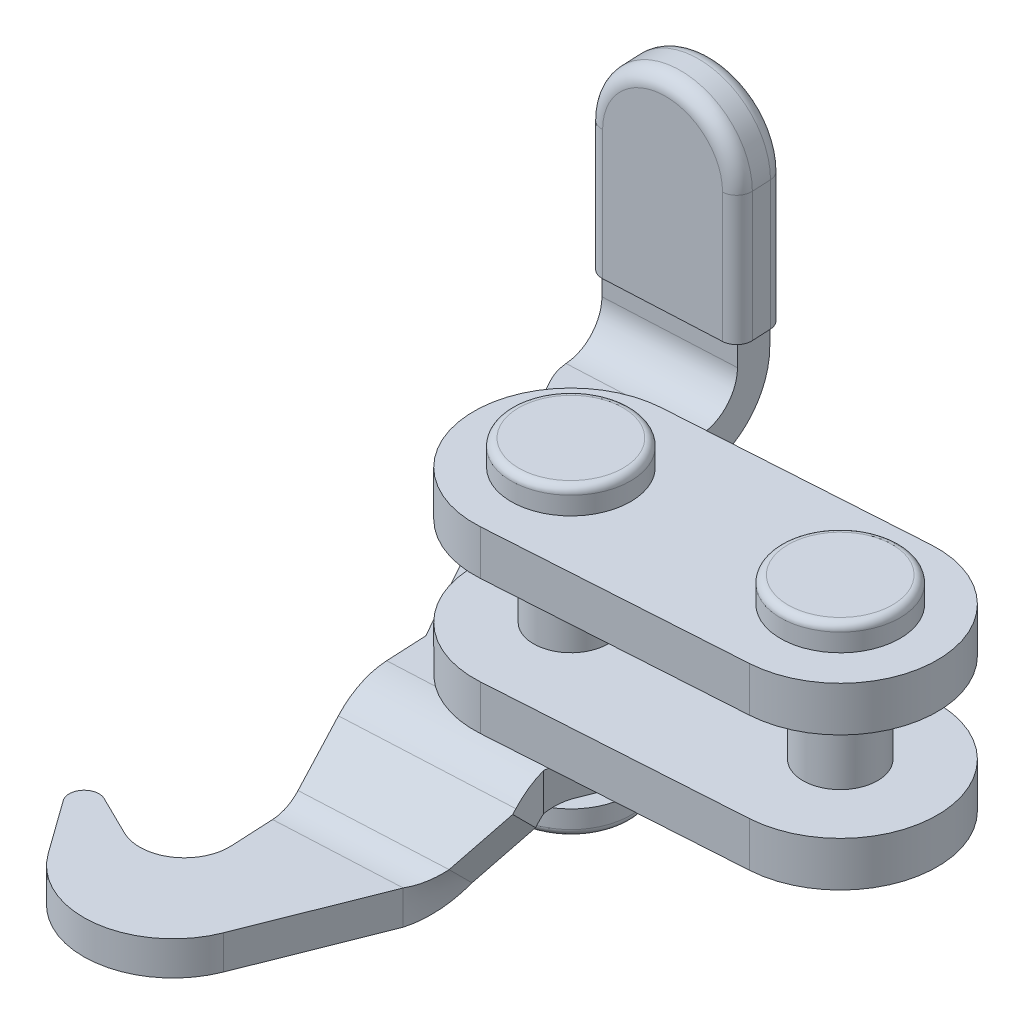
ISO-10303-21;
HEADER;
FILE_DESCRIPTION(('STEP AP214'),'2;1');
FILE_NAME('part.step','',(''),(''),'','','');
FILE_SCHEMA(('AUTOMOTIVE_DESIGN { 1 0 10303 214 1 1 1 1 }'));
ENDSEC;
DATA;
#1=APPLICATION_CONTEXT('core data for automotive mechanical design processes');
#2=APPLICATION_PROTOCOL_DEFINITION('international standard','automotive_design',2000,#1);
#3=PRODUCT_CONTEXT('',#1,'mechanical');
#4=PRODUCT('Part','Part','',(#3));
#5=PRODUCT_RELATED_PRODUCT_CATEGORY('part','',(#4));
#6=PRODUCT_DEFINITION_FORMATION('','',#4);
#7=PRODUCT_DEFINITION_CONTEXT('part definition',#1,'design');
#8=PRODUCT_DEFINITION('design','',#6,#7);
#9=PRODUCT_DEFINITION_SHAPE('','',#8);
#10=(LENGTH_UNIT() NAMED_UNIT(*) SI_UNIT(.MILLI.,.METRE.));
#11=(NAMED_UNIT(*) PLANE_ANGLE_UNIT() SI_UNIT($,.RADIAN.));
#12=(NAMED_UNIT(*) SI_UNIT($,.STERADIAN.) SOLID_ANGLE_UNIT());
#13=UNCERTAINTY_MEASURE_WITH_UNIT(LENGTH_MEASURE(1.E-05),#10,'distance_accuracy_value','');
#14=(GEOMETRIC_REPRESENTATION_CONTEXT(3) GLOBAL_UNCERTAINTY_ASSIGNED_CONTEXT((#13)) GLOBAL_UNIT_ASSIGNED_CONTEXT((#10,
#11,#12)) REPRESENTATION_CONTEXT('',''));
#15=CARTESIAN_POINT('',(0.,0.,0.));
#16=DIRECTION('',(0.,0.,1.));
#17=DIRECTION('',(1.,0.,0.));
#18=AXIS2_PLACEMENT_3D('',#15,#16,#17);
#19=CARTESIAN_POINT('',(63.9114193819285,7.69999999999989,-72.30829595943));
#20=DIRECTION('',(0.,-1.,0.));
#21=DIRECTION('',(-1.,0.,0.));
#22=AXIS2_PLACEMENT_3D('',#19,#20,#21);
#23=PLANE('',#22);
#24=CARTESIAN_POINT('',(63.9114193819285,7.69999999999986,-72.30829595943));
#25=DIRECTION('',(0.,-1.,0.));
#26=DIRECTION('',(-1.,0.,0.));
#27=AXIS2_PLACEMENT_3D('',#24,#25,#26);
#28=CIRCLE('',#27,3.5);
#29=CARTESIAN_POINT('',(60.4114193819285,7.69999999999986,-72.30829595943));
#30=VERTEX_POINT('',#29);
#31=CARTESIAN_POINT('',(67.4114193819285,7.69999999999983,-72.30829595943));
#32=VERTEX_POINT('',#31);
#33=EDGE_CURVE('E358',#30,#32,#28,.T.);
#34=ORIENTED_EDGE('',*,*,#33,.F.);
#35=CARTESIAN_POINT('',(63.9114193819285,7.69999999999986,-72.30829595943));
#36=DIRECTION('',(0.,-1.,0.));
#37=DIRECTION('',(1.,0.,0.));
#38=AXIS2_PLACEMENT_3D('',#35,#36,#37);
#39=CIRCLE('',#38,3.5);
#40=EDGE_CURVE('E363',#32,#30,#39,.T.);
#41=ORIENTED_EDGE('',*,*,#40,.F.);
#42=EDGE_LOOP('',(#34,#41));
#43=FACE_BOUND('',#42,.T.);
#44=ADVANCED_FACE('F14',(#43),#23,.F.);
#45=CARTESIAN_POINT('',(63.9114193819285,7.19999999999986,-72.30829595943));
#46=DIRECTION('',(0.,-1.,0.));
#47=DIRECTION('',(-1.,0.,0.));
#48=AXIS2_PLACEMENT_3D('',#45,#46,#47);
#49=TOROIDAL_SURFACE('',#48,3.5,0.5);
#50=ORIENTED_EDGE('',*,*,#33,.T.);
#51=ORIENTED_EDGE('',*,*,#40,.T.);
#52=EDGE_LOOP('',(#50,#51));
#53=FACE_BOUND('',#52,.T.);
#54=CARTESIAN_POINT('',(63.9114193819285,7.19999999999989,-72.30829595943));
#55=DIRECTION('',(0.,1.,0.));
#56=DIRECTION('',(1.,0.,0.));
#57=AXIS2_PLACEMENT_3D('',#54,#55,#56);
#58=CIRCLE('',#57,4.);
#59=CARTESIAN_POINT('',(67.9114193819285,7.19999999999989,-72.30829595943));
#60=VERTEX_POINT('',#59);
#61=EDGE_CURVE('E431',#60,#60,#58,.F.);
#62=ORIENTED_EDGE('',*,*,#61,.F.);
#63=EDGE_LOOP('',(#62));
#64=FACE_BOUND('',#63,.T.);
#65=ADVANCED_FACE('F361',(#53,#64),#49,.T.);
#66=CARTESIAN_POINT('',(63.9114193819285,5.99999999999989,-72.30829595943));
#67=DIRECTION('',(0.,1.,0.));
#68=DIRECTION('',(1.,0.,0.));
#69=AXIS2_PLACEMENT_3D('',#66,#67,#68);
#70=CYLINDRICAL_SURFACE('',#69,4.);
#71=ORIENTED_EDGE('',*,*,#61,.T.);
#72=EDGE_LOOP('',(#71));
#73=FACE_BOUND('',#72,.T.);
#74=CARTESIAN_POINT('',(63.9114193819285,6.,-72.30829595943));
#75=DIRECTION('',(0.,-1.,0.));
#76=DIRECTION('',(0.,0.,-1.));
#77=AXIS2_PLACEMENT_3D('',#74,#75,#76);
#78=CIRCLE('',#77,4.);
#79=CARTESIAN_POINT('',(63.9114193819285,6.,-76.30829595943));
#80=VERTEX_POINT('',#79);
#81=EDGE_CURVE('E1054',#80,#80,#78,.T.);
#82=ORIENTED_EDGE('',*,*,#81,.F.);
#83=EDGE_LOOP('',(#82));
#84=FACE_BOUND('',#83,.T.);
#85=ADVANCED_FACE('F449',(#73,#84),#70,.T.);
#86=CARTESIAN_POINT('',(63.9114193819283,6.,-72.3082959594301));
#87=DIRECTION('',(0.,-1.,0.));
#88=DIRECTION('',(-0.997977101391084,0.,0.0635744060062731));
#89=AXIS2_PLACEMENT_3D('',#86,#87,#88);
#90=PLANE('',#89);
#91=ORIENTED_EDGE('',*,*,#81,.T.);
#92=EDGE_LOOP('',(#91));
#93=FACE_BOUND('',#92,.T.);
#94=DIRECTION('',(0.997977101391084,0.,-0.0635744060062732));
#95=VECTOR('',#94,1.);
#96=CARTESIAN_POINT('',(64.3246530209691,6.,-65.821444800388));
#97=LINE('',#96,#95);
#98=CARTESIAN_POINT('',(64.3246530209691,6.,-65.821444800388));
#99=VERTEX_POINT('',#98);
#100=CARTESIAN_POINT('',(81.2902637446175,6.,-66.9022097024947));
#101=VERTEX_POINT('',#100);
#102=EDGE_CURVE('E576',#99,#101,#97,.T.);
#103=ORIENTED_EDGE('',*,*,#102,.T.);
#104=CARTESIAN_POINT('',(80.8770301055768,6.,-73.3890608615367));
#105=DIRECTION('',(0.,1.,0.));
#106=DIRECTION('',(0.997977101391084,0.,-0.0635744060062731));
#107=AXIS2_PLACEMENT_3D('',#104,#105,#106);
#108=CIRCLE('',#107,6.5);
#109=CARTESIAN_POINT('',(80.463796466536,6.,-79.8759120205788));
#110=VERTEX_POINT('',#109);
#111=EDGE_CURVE('E573',#110,#101,#108,.F.);
#112=ORIENTED_EDGE('',*,*,#111,.F.);
#113=DIRECTION('',(-0.997977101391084,0.,0.063574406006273));
#114=VECTOR('',#113,1.);
#115=CARTESIAN_POINT('',(63.4981857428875,6.,-78.7951471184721));
#116=LINE('',#115,#114);
#117=CARTESIAN_POINT('',(63.4981857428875,6.,-78.7951471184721));
#118=VERTEX_POINT('',#117);
#119=EDGE_CURVE('E580',#110,#118,#116,.T.);
#120=ORIENTED_EDGE('',*,*,#119,.T.);
#121=CARTESIAN_POINT('',(63.9114193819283,6.,-72.3082959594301));
#122=DIRECTION('',(0.,1.,0.));
#123=DIRECTION('',(0.997977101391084,0.,-0.0635744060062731));
#124=AXIS2_PLACEMENT_3D('',#121,#122,#123);
#125=CIRCLE('',#124,6.5);
#126=EDGE_CURVE('E583',#99,#118,#125,.F.);
#127=ORIENTED_EDGE('',*,*,#126,.F.);
#128=EDGE_LOOP('',(#103,#112,#120,#127));
#129=FACE_BOUND('',#128,.T.);
#130=CARTESIAN_POINT('',(80.8770301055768,6.,-73.3890608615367));
#131=DIRECTION('',(0.,-1.,0.));
#132=DIRECTION('',(0.,0.,-1.));
#133=AXIS2_PLACEMENT_3D('',#130,#131,#132);
#134=CIRCLE('',#133,4.);
#135=CARTESIAN_POINT('',(80.8770301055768,6.,-77.3890608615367));
#136=VERTEX_POINT('',#135);
#137=EDGE_CURVE('E1219',#136,#136,#134,.T.);
#138=ORIENTED_EDGE('',*,*,#137,.T.);
#139=EDGE_LOOP('',(#138));
#140=FACE_BOUND('',#139,.T.);
#141=ADVANCED_FACE('F1489',(#93,#129,#140),#90,.F.);
#142=CARTESIAN_POINT('',(63.9114193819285,-11.,-72.30829595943));
#143=DIRECTION('',(0.,-1.,0.));
#144=DIRECTION('',(-1.,0.,0.));
#145=AXIS2_PLACEMENT_3D('',#142,#143,#144);
#146=CYLINDRICAL_SURFACE('',#145,4.);
#147=CARTESIAN_POINT('',(63.9114193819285,-12.2,-72.30829595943));
#148=DIRECTION('',(0.,-1.,0.));
#149=DIRECTION('',(-1.,0.,0.));
#150=AXIS2_PLACEMENT_3D('',#147,#148,#149);
#151=CIRCLE('',#150,4.);
#152=CARTESIAN_POINT('',(59.9114193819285,-12.2,-72.30829595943));
#153=VERTEX_POINT('',#152);
#154=EDGE_CURVE('E371',#153,#153,#151,.F.);
#155=ORIENTED_EDGE('',*,*,#154,.T.);
#156=EDGE_LOOP('',(#155));
#157=FACE_BOUND('',#156,.T.);
#158=CARTESIAN_POINT('',(63.9114193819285,-11.,-72.30829595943));
#159=DIRECTION('',(0.,1.,0.));
#160=DIRECTION('',(0.,0.,1.));
#161=AXIS2_PLACEMENT_3D('',#158,#159,#160);
#162=CIRCLE('',#161,4.);
#163=CARTESIAN_POINT('',(63.9114193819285,-11.,-68.30829595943));
#164=VERTEX_POINT('',#163);
#165=EDGE_CURVE('E475',#164,#164,#162,.F.);
#166=ORIENTED_EDGE('',*,*,#165,.T.);
#167=EDGE_LOOP('',(#166));
#168=FACE_BOUND('',#167,.T.);
#169=ADVANCED_FACE('F398',(#157,#168),#146,.T.);
#170=CARTESIAN_POINT('',(63.9114193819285,-12.7,-72.30829595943));
#171=DIRECTION('',(0.,1.,0.));
#172=DIRECTION('',(1.,0.,0.));
#173=AXIS2_PLACEMENT_3D('',#170,#171,#172);
#174=PLANE('',#173);
#175=CARTESIAN_POINT('',(63.9114193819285,-12.7000000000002,-72.30829595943));
#176=DIRECTION('',(0.,1.,0.));
#177=DIRECTION('',(1.,0.,0.));
#178=AXIS2_PLACEMENT_3D('',#175,#176,#177);
#179=CIRCLE('',#178,3.5);
#180=CARTESIAN_POINT('',(67.4114193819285,-12.7000000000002,-72.30829595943));
#181=VERTEX_POINT('',#180);
#182=CARTESIAN_POINT('',(60.4114193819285,-12.7000000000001,-72.30829595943));
#183=VERTEX_POINT('',#182);
#184=EDGE_CURVE('E463',#181,#183,#179,.T.);
#185=ORIENTED_EDGE('',*,*,#184,.F.);
#186=CARTESIAN_POINT('',(63.9114193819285,-12.7000000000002,-72.30829595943));
#187=DIRECTION('',(0.,1.,0.));
#188=DIRECTION('',(-1.,0.,0.));
#189=AXIS2_PLACEMENT_3D('',#186,#187,#188);
#190=CIRCLE('',#189,3.5);
#191=EDGE_CURVE('E367',#183,#181,#190,.T.);
#192=ORIENTED_EDGE('',*,*,#191,.F.);
#193=EDGE_LOOP('',(#185,#192));
#194=FACE_BOUND('',#193,.T.);
#195=ADVANCED_FACE('F393',(#194),#174,.F.);
#196=CARTESIAN_POINT('',(63.9114193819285,-12.2000000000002,-72.30829595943));
#197=DIRECTION('',(0.,1.,0.));
#198=DIRECTION('',(1.,0.,0.));
#199=AXIS2_PLACEMENT_3D('',#196,#197,#198);
#200=TOROIDAL_SURFACE('',#199,3.5,0.5);
#201=ORIENTED_EDGE('',*,*,#184,.T.);
#202=ORIENTED_EDGE('',*,*,#191,.T.);
#203=EDGE_LOOP('',(#201,#202));
#204=FACE_BOUND('',#203,.T.);
#205=ORIENTED_EDGE('',*,*,#154,.F.);
#206=EDGE_LOOP('',(#205));
#207=FACE_BOUND('',#206,.T.);
#208=ADVANCED_FACE('F389',(#204,#207),#200,.T.);
#209=CARTESIAN_POINT('',(63.9114193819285,-11.,-72.30829595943));
#210=DIRECTION('',(0.,1.,0.));
#211=DIRECTION('',(1.,0.,0.));
#212=AXIS2_PLACEMENT_3D('',#209,#210,#211);
#213=CYLINDRICAL_SURFACE('',#212,2.5);
#214=CARTESIAN_POINT('',(63.9114193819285,3.,-72.30829595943));
#215=DIRECTION('',(0.,-1.,0.));
#216=DIRECTION('',(1.,0.,0.));
#217=AXIS2_PLACEMENT_3D('',#214,#215,#216);
#218=CIRCLE('',#217,2.5);
#219=CARTESIAN_POINT('',(66.4114193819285,3.,-72.30829595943));
#220=VERTEX_POINT('',#219);
#221=EDGE_CURVE('E472',#220,#220,#218,.F.);
#222=ORIENTED_EDGE('',*,*,#221,.F.);
#223=EDGE_LOOP('',(#222));
#224=FACE_BOUND('',#223,.T.);
#225=CARTESIAN_POINT('',(63.9114193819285,-2.99999999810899,-72.30829595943));
#226=DIRECTION('',(0.,-1.,0.));
#227=DIRECTION('',(1.,0.,0.));
#228=AXIS2_PLACEMENT_3D('',#225,#226,#227);
#229=CIRCLE('',#228,2.5);
#230=CARTESIAN_POINT('',(66.4114193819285,-2.99999999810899,-72.30829595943));
#231=VERTEX_POINT('',#230);
#232=EDGE_CURVE('E430',#231,#231,#229,.F.);
#233=ORIENTED_EDGE('',*,*,#232,.T.);
#234=EDGE_LOOP('',(#233));
#235=FACE_BOUND('',#234,.T.);
#236=ADVANCED_FACE('F1448',(#224,#235),#213,.T.);
#237=CARTESIAN_POINT('',(63.9114193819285,-11.,-72.30829595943));
#238=DIRECTION('',(0.,1.,0.));
#239=DIRECTION('',(1.,0.,0.));
#240=AXIS2_PLACEMENT_3D('',#237,#238,#239);
#241=PLANE('',#240);
#242=ORIENTED_EDGE('',*,*,#165,.F.);
#243=EDGE_LOOP('',(#242));
#244=FACE_BOUND('',#243,.T.);
#245=CARTESIAN_POINT('',(63.9114193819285,-11.,-72.30829595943));
#246=DIRECTION('',(0.,1.,0.));
#247=DIRECTION('',(1.,0.,0.));
#248=AXIS2_PLACEMENT_3D('',#245,#246,#247);
#249=CIRCLE('',#248,2.5);
#250=CARTESIAN_POINT('',(66.4114193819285,-11.,-72.30829595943));
#251=VERTEX_POINT('',#250);
#252=EDGE_CURVE('E423',#251,#251,#249,.T.);
#253=ORIENTED_EDGE('',*,*,#252,.F.);
#254=EDGE_LOOP('',(#253));
#255=FACE_BOUND('',#254,.T.);
#256=ADVANCED_FACE('F1446',(#244,#255),#241,.T.);
#257=CARTESIAN_POINT('',(63.9114193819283,-8.27837999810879,-72.3082959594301));
#258=DIRECTION('',(0.,-1.,0.));
#259=DIRECTION('',(-0.998798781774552,0.,0.0489999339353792));
#260=AXIS2_PLACEMENT_3D('',#257,#258,#259);
#261=CIRCLE('',#260,2.5);
#262=CARTESIAN_POINT('',(61.4144224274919,-8.27837999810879,-72.1857961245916));
#263=VERTEX_POINT('',#262);
#264=EDGE_CURVE('E435',#263,#263,#261,.F.);
#265=ORIENTED_EDGE('',*,*,#264,.F.);
#266=EDGE_LOOP('',(#265));
#267=FACE_BOUND('',#266,.T.);
#268=ORIENTED_EDGE('',*,*,#252,.T.);
#269=EDGE_LOOP('',(#268));
#270=FACE_BOUND('',#269,.T.);
#271=ADVANCED_FACE('F450',(#267,#270),#213,.T.);
#272=CARTESIAN_POINT('',(49.8373451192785,6.75035854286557,-94.6905364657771));
#273=DIRECTION('',(0.0489999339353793,0.,0.998798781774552));
#274=DIRECTION('',(0.,1.,0.));
#275=AXIS2_PLACEMENT_3D('',#272,#273,#274);
#276=TOROIDAL_SURFACE('',#275,3.83500000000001,1.);
#277=CARTESIAN_POINT('',(46.0069517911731,6.75035854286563,-94.502621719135));
#278=DIRECTION('',(0.,-1.,0.));
#279=DIRECTION('',(-0.998798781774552,0.,0.0489999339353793));
#280=AXIS2_PLACEMENT_3D('',#277,#278,#279);
#281=CIRCLE('',#280,1.);
#282=CARTESIAN_POINT('',(45.9579518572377,6.75035854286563,-95.5014205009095));
#283=VERTEX_POINT('',#282);
#284=CARTESIAN_POINT('',(45.0081530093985,6.75035854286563,-94.4536217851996));
#285=VERTEX_POINT('',#284);
#286=EDGE_CURVE('E780',#283,#285,#281,.F.);
#287=ORIENTED_EDGE('',*,*,#286,.T.);
#288=CARTESIAN_POINT('',(49.8373451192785,6.75035854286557,-94.6905364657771));
#289=DIRECTION('',(0.0489999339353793,0.,0.998798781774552));
#290=DIRECTION('',(0.,1.,0.));
#291=AXIS2_PLACEMENT_3D('',#288,#289,#290);
#292=CIRCLE('',#291,4.835);
#293=CARTESIAN_POINT('',(54.6665372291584,6.75035854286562,-94.9274511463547));
#294=VERTEX_POINT('',#293);
#295=EDGE_CURVE('E787',#285,#294,#292,.F.);
#296=ORIENTED_EDGE('',*,*,#295,.T.);
#297=CARTESIAN_POINT('',(53.6677384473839,6.75035854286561,-94.8784512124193));
#298=DIRECTION('',(0.,1.,0.));
#299=DIRECTION('',(0.998798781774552,0.,-0.0489999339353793));
#300=AXIS2_PLACEMENT_3D('',#297,#298,#299);
#301=CIRCLE('',#300,1.);
#302=CARTESIAN_POINT('',(53.6187385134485,6.75035854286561,-95.8772499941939));
#303=VERTEX_POINT('',#302);
#304=EDGE_CURVE('E788',#294,#303,#301,.T.);
#305=ORIENTED_EDGE('',*,*,#304,.T.);
#306=CARTESIAN_POINT('',(49.7883451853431,6.75035854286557,-95.6893352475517));
#307=DIRECTION('',(0.0489999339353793,0.,0.998798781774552));
#308=DIRECTION('',(0.998798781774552,0.,-0.0489999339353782));
#309=AXIS2_PLACEMENT_3D('',#306,#307,#308);
#310=CIRCLE('',#309,3.83500000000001);
#311=CARTESIAN_POINT('',(49.7883451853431,10.5853585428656,-95.6893352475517));
#312=VERTEX_POINT('',#311);
#313=EDGE_CURVE('E718',#303,#312,#310,.T.);
#314=ORIENTED_EDGE('',*,*,#313,.T.);
#315=CARTESIAN_POINT('',(49.7883451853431,6.75035854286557,-95.6893352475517));
#316=DIRECTION('',(0.0489999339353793,0.,0.998798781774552));
#317=DIRECTION('',(0.,1.,0.));
#318=AXIS2_PLACEMENT_3D('',#315,#316,#317);
#319=CIRCLE('',#318,3.83500000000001);
#320=EDGE_CURVE('E716',#312,#283,#319,.T.);
#321=ORIENTED_EDGE('',*,*,#320,.T.);
#322=EDGE_LOOP('',(#287,#296,#305,#314,#321));
#323=FACE_BOUND('',#322,.T.);
#324=ADVANCED_FACE('F770',(#323),#276,.T.);
#325=CARTESIAN_POINT('',(49.9245650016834,6.75035854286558,-92.9126746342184));
#326=DIRECTION('',(-0.0489999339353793,0.,-0.998798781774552));
#327=DIRECTION('',(0.,-1.,0.));
#328=AXIS2_PLACEMENT_3D('',#325,#326,#327);
#329=CYLINDRICAL_SURFACE('',#328,4.835);
#330=DIRECTION('',(-0.0489999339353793,0.,-0.998798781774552));
#331=VECTOR('',#330,1.);
#332=CARTESIAN_POINT('',(54.7537571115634,6.75035854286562,-93.149589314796));
#333=LINE('',#332,#331);
#334=CARTESIAN_POINT('',(54.7292571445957,6.75035854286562,-93.6489887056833));
#335=VERTEX_POINT('',#334);
#336=EDGE_CURVE('E804',#335,#294,#333,.T.);
#337=ORIENTED_EDGE('',*,*,#336,.T.);
#338=ORIENTED_EDGE('',*,*,#295,.F.);
#339=DIRECTION('',(-0.0489999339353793,0.,-0.998798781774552));
#340=VECTOR('',#339,1.);
#341=CARTESIAN_POINT('',(45.0953728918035,6.75035854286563,-92.6757599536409));
#342=LINE('',#341,#340);
#343=CARTESIAN_POINT('',(45.0708729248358,6.75035854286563,-93.1751593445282));
#344=VERTEX_POINT('',#343);
#345=EDGE_CURVE('E812',#285,#344,#342,.F.);
#346=ORIENTED_EDGE('',*,*,#345,.T.);
#347=CARTESIAN_POINT('',(49.9000650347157,6.75035854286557,-93.4120740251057));
#348=DIRECTION('',(-0.0489999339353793,0.,-0.998798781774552));
#349=DIRECTION('',(0.,-1.,0.));
#350=AXIS2_PLACEMENT_3D('',#347,#348,#349);
#351=CIRCLE('',#350,4.835);
#352=EDGE_CURVE('E764',#335,#344,#351,.F.);
#353=ORIENTED_EDGE('',*,*,#352,.F.);
#354=EDGE_LOOP('',(#337,#338,#346,#353));
#355=FACE_BOUND('',#354,.T.);
#356=ADVANCED_FACE('F751',(#355),#329,.T.);
#357=CARTESIAN_POINT('',(49.9000650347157,6.75035854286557,-93.4120740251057));
#358=DIRECTION('',(-0.0489999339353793,0.,-0.998798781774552));
#359=DIRECTION('',(0.,-1.,0.));
#360=AXIS2_PLACEMENT_3D('',#357,#358,#359);
#361=TOROIDAL_SURFACE('',#360,3.835,1.);
#362=CARTESIAN_POINT('',(53.7304583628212,6.75035854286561,-93.5999887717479));
#363=DIRECTION('',(0.,1.,0.));
#364=DIRECTION('',(0.998798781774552,0.,-0.0489999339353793));
#365=AXIS2_PLACEMENT_3D('',#362,#363,#364);
#366=CIRCLE('',#365,1.);
#367=CARTESIAN_POINT('',(53.7794582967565,6.75035854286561,-92.6011899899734));
#368=VERTEX_POINT('',#367);
#369=EDGE_CURVE('E731',#335,#368,#366,.F.);
#370=ORIENTED_EDGE('',*,*,#369,.F.);
#371=ORIENTED_EDGE('',*,*,#352,.T.);
#372=CARTESIAN_POINT('',(46.0696717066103,6.75035854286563,-93.2241592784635));
#373=DIRECTION('',(0.,1.,0.));
#374=DIRECTION('',(-0.998798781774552,0.,0.0489999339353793));
#375=AXIS2_PLACEMENT_3D('',#372,#373,#374);
#376=CIRCLE('',#375,1.);
#377=CARTESIAN_POINT('',(46.1186716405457,6.75035854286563,-92.225360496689));
#378=VERTEX_POINT('',#377);
#379=EDGE_CURVE('E756',#344,#378,#376,.T.);
#380=ORIENTED_EDGE('',*,*,#379,.T.);
#381=CARTESIAN_POINT('',(49.9490649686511,6.75035854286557,-92.4132752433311));
#382=DIRECTION('',(-0.0489999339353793,0.,-0.998798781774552));
#383=DIRECTION('',(-0.998798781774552,0.,0.0489999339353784));
#384=AXIS2_PLACEMENT_3D('',#381,#382,#383);
#385=CIRCLE('',#384,3.835);
#386=EDGE_CURVE('E668',#378,#368,#385,.T.);
#387=ORIENTED_EDGE('',*,*,#386,.T.);
#388=EDGE_LOOP('',(#370,#371,#380,#387));
#389=FACE_BOUND('',#388,.T.);
#390=ADVANCED_FACE('F746',(#389),#361,.T.);
#391=CARTESIAN_POINT('',(54.7537571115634,-1.91464145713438,-93.149589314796));
#392=DIRECTION('',(-0.998798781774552,0.,0.0489999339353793));
#393=DIRECTION('',(0.,1.,0.));
#394=AXIS2_PLACEMENT_3D('',#391,#392,#393);
#395=PLANE('',#394);
#396=DIRECTION('',(0.,1.,0.));
#397=VECTOR('',#396,1.);
#398=CARTESIAN_POINT('',(54.7292571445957,-1.91464145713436,-93.6489887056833));
#399=LINE('',#398,#397);
#400=CARTESIAN_POINT('',(54.7292571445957,-1.91464145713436,-93.6489887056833));
#401=VERTEX_POINT('',#400);
#402=EDGE_CURVE('E740',#401,#335,#399,.T.);
#403=ORIENTED_EDGE('',*,*,#402,.F.);
#404=DIRECTION('',(-0.0489999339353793,0.,-0.998798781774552));
#405=VECTOR('',#404,1.);
#406=CARTESIAN_POINT('',(54.7537571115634,-1.91464145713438,-93.149589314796));
#407=LINE('',#406,#405);
#408=CARTESIAN_POINT('',(54.6665372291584,-1.91464145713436,-94.9274511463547));
#409=VERTEX_POINT('',#408);
#410=EDGE_CURVE('E808',#409,#401,#407,.F.);
#411=ORIENTED_EDGE('',*,*,#410,.F.);
#412=DIRECTION('',(0.,1.,0.));
#413=VECTOR('',#412,1.);
#414=CARTESIAN_POINT('',(54.6665372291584,-1.91464145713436,-94.9274511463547));
#415=LINE('',#414,#413);
#416=EDGE_CURVE('E792',#294,#409,#415,.F.);
#417=ORIENTED_EDGE('',*,*,#416,.F.);
#418=ORIENTED_EDGE('',*,*,#336,.F.);
#419=EDGE_LOOP('',(#403,#411,#417,#418));
#420=FACE_BOUND('',#419,.T.);
#421=ADVANCED_FACE('F750',(#420),#395,.F.);
#422=CARTESIAN_POINT('',(53.6677384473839,-1.91464145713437,-94.8784512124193));
#423=DIRECTION('',(0.,1.,0.));
#424=DIRECTION('',(0.998798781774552,0.,-0.0489999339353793));
#425=AXIS2_PLACEMENT_3D('',#422,#423,#424);
#426=CYLINDRICAL_SURFACE('',#425,1.);
#427=ORIENTED_EDGE('',*,*,#304,.F.);
#428=ORIENTED_EDGE('',*,*,#416,.T.);
#429=CARTESIAN_POINT('',(53.6677384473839,-1.91464145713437,-94.8784512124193));
#430=DIRECTION('',(0.,1.,0.));
#431=DIRECTION('',(0.998798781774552,0.,-0.0489999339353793));
#432=AXIS2_PLACEMENT_3D('',#429,#430,#431);
#433=CIRCLE('',#432,1.);
#434=CARTESIAN_POINT('',(53.6187385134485,-1.91464145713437,-95.8772499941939));
#435=VERTEX_POINT('',#434);
#436=EDGE_CURVE('E828',#409,#435,#433,.T.);
#437=ORIENTED_EDGE('',*,*,#436,.T.);
#438=DIRECTION('',(0.,1.,0.));
#439=VECTOR('',#438,1.);
#440=CARTESIAN_POINT('',(53.6187385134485,-1.91464145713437,-95.8772499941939));
#441=LINE('',#440,#439);
#442=EDGE_CURVE('E727',#435,#303,#441,.T.);
#443=ORIENTED_EDGE('',*,*,#442,.T.);
#444=EDGE_LOOP('',(#427,#428,#437,#443));
#445=FACE_BOUND('',#444,.T.);
#446=ADVANCED_FACE('F693',(#445),#426,.T.);
#447=CARTESIAN_POINT('',(54.1181379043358,-1.91464145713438,-95.9017499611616));
#448=DIRECTION('',(0.0489999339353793,0.,0.998798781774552));
#449=DIRECTION('',(0.,1.,0.));
#450=AXIS2_PLACEMENT_3D('',#447,#448,#449);
#451=PLANE('',#450);
#452=ORIENTED_EDGE('',*,*,#313,.F.);
#453=ORIENTED_EDGE('',*,*,#442,.F.);
#454=DIRECTION('',(0.998798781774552,0.,-0.0489999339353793));
#455=VECTOR('',#454,1.);
#456=CARTESIAN_POINT('',(54.1181379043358,-1.91464145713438,-95.9017499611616));
#457=LINE('',#456,#455);
#458=CARTESIAN_POINT('',(45.9579518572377,-1.91464145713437,-95.5014205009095));
#459=VERTEX_POINT('',#458);
#460=EDGE_CURVE('E656',#435,#459,#457,.F.);
#461=ORIENTED_EDGE('',*,*,#460,.T.);
#462=DIRECTION('',(0.,1.,0.));
#463=VECTOR('',#462,1.);
#464=CARTESIAN_POINT('',(45.9579518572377,-1.91464145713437,-95.5014205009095));
#465=LINE('',#464,#463);
#466=EDGE_CURVE('E721',#283,#459,#465,.F.);
#467=ORIENTED_EDGE('',*,*,#466,.F.);
#468=ORIENTED_EDGE('',*,*,#320,.F.);
#469=EDGE_LOOP('',(#452,#453,#461,#467,#468));
#470=FACE_BOUND('',#469,.T.);
#471=ADVANCED_FACE('F688',(#470),#451,.F.);
#472=CARTESIAN_POINT('',(46.0069517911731,-1.91464145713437,-94.502621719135));
#473=DIRECTION('',(0.,1.,0.));
#474=DIRECTION('',(0.998798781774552,0.,-0.0489999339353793));
#475=AXIS2_PLACEMENT_3D('',#472,#473,#474);
#476=CYLINDRICAL_SURFACE('',#475,1.);
#477=ORIENTED_EDGE('',*,*,#286,.F.);
#478=ORIENTED_EDGE('',*,*,#466,.T.);
#479=CARTESIAN_POINT('',(46.0069517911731,-1.91464145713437,-94.502621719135));
#480=DIRECTION('',(0.,1.,0.));
#481=DIRECTION('',(0.998798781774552,0.,-0.0489999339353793));
#482=AXIS2_PLACEMENT_3D('',#479,#480,#481);
#483=CIRCLE('',#482,1.);
#484=CARTESIAN_POINT('',(45.0081530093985,-1.91464145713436,-94.4536217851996));
#485=VERTEX_POINT('',#484);
#486=EDGE_CURVE('E807',#459,#485,#483,.T.);
#487=ORIENTED_EDGE('',*,*,#486,.T.);
#488=DIRECTION('',(0.,1.,0.));
#489=VECTOR('',#488,1.);
#490=CARTESIAN_POINT('',(45.0081530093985,-1.91464145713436,-94.4536217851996));
#491=LINE('',#490,#489);
#492=EDGE_CURVE('E825',#485,#285,#491,.T.);
#493=ORIENTED_EDGE('',*,*,#492,.T.);
#494=EDGE_LOOP('',(#477,#478,#487,#493));
#495=FACE_BOUND('',#494,.T.);
#496=ADVANCED_FACE('F692',(#495),#476,.T.);
#497=CARTESIAN_POINT('',(45.0953728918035,-1.91464145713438,-92.6757599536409));
#498=DIRECTION('',(0.998798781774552,0.,-0.0489999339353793));
#499=DIRECTION('',(0.,-1.,0.));
#500=AXIS2_PLACEMENT_3D('',#497,#498,#499);
#501=PLANE('',#500);
#502=DIRECTION('',(0.,1.,0.));
#503=VECTOR('',#502,1.);
#504=CARTESIAN_POINT('',(45.0708729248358,-1.91464145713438,-93.1751593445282));
#505=LINE('',#504,#503);
#506=CARTESIAN_POINT('',(45.0708729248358,-1.91464145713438,-93.1751593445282));
#507=VERTEX_POINT('',#506);
#508=EDGE_CURVE('E765',#344,#507,#505,.F.);
#509=ORIENTED_EDGE('',*,*,#508,.F.);
#510=ORIENTED_EDGE('',*,*,#345,.F.);
#511=ORIENTED_EDGE('',*,*,#492,.F.);
#512=DIRECTION('',(-0.0489999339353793,0.,-0.998798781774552));
#513=VECTOR('',#512,1.);
#514=CARTESIAN_POINT('',(45.0953728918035,-1.91464145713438,-92.6757599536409));
#515=LINE('',#514,#513);
#516=EDGE_CURVE('E815',#507,#485,#515,.T.);
#517=ORIENTED_EDGE('',*,*,#516,.F.);
#518=EDGE_LOOP('',(#509,#510,#511,#517));
#519=FACE_BOUND('',#518,.T.);
#520=ADVANCED_FACE('F855',(#519),#501,.F.);
#521=CARTESIAN_POINT('',(46.0696717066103,-1.91464145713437,-93.2241592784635));
#522=DIRECTION('',(0.,1.,0.));
#523=DIRECTION('',(0.998798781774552,0.,-0.0489999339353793));
#524=AXIS2_PLACEMENT_3D('',#521,#522,#523);
#525=CYLINDRICAL_SURFACE('',#524,1.);
#526=ORIENTED_EDGE('',*,*,#379,.F.);
#527=ORIENTED_EDGE('',*,*,#508,.T.);
#528=CARTESIAN_POINT('',(46.0696717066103,-1.91464145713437,-93.2241592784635));
#529=DIRECTION('',(0.,1.,0.));
#530=DIRECTION('',(0.998798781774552,0.,-0.0489999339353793));
#531=AXIS2_PLACEMENT_3D('',#528,#529,#530);
#532=CIRCLE('',#531,1.);
#533=CARTESIAN_POINT('',(46.1186716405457,-1.91464145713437,-92.225360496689));
#534=VERTEX_POINT('',#533);
#535=EDGE_CURVE('E820',#507,#534,#532,.T.);
#536=ORIENTED_EDGE('',*,*,#535,.T.);
#537=DIRECTION('',(0.,-1.,0.));
#538=VECTOR('',#537,1.);
#539=CARTESIAN_POINT('',(46.1186716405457,-1.91464145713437,-92.225360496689));
#540=LINE('',#539,#538);
#541=EDGE_CURVE('E725',#534,#378,#540,.F.);
#542=ORIENTED_EDGE('',*,*,#541,.T.);
#543=EDGE_LOOP('',(#526,#527,#536,#542));
#544=FACE_BOUND('',#543,.T.);
#545=ADVANCED_FACE('F685',(#544),#525,.T.);
#546=CARTESIAN_POINT('',(54.2788576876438,-1.91464145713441,-92.6256899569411));
#547=DIRECTION('',(-0.0489999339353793,0.,-0.998798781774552));
#548=DIRECTION('',(0.,-1.,0.));
#549=AXIS2_PLACEMENT_3D('',#546,#547,#548);
#550=PLANE('',#549);
#551=DIRECTION('',(0.,-1.,0.));
#552=VECTOR('',#551,1.);
#553=CARTESIAN_POINT('',(53.7794582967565,-1.9146414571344,-92.6011899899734));
#554=LINE('',#553,#552);
#555=CARTESIAN_POINT('',(53.7794582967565,-1.9146414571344,-92.6011899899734));
#556=VERTEX_POINT('',#555);
#557=EDGE_CURVE('E657',#368,#556,#554,.T.);
#558=ORIENTED_EDGE('',*,*,#557,.F.);
#559=ORIENTED_EDGE('',*,*,#386,.F.);
#560=ORIENTED_EDGE('',*,*,#541,.F.);
#561=DIRECTION('',(0.998798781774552,0.,-0.0489999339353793));
#562=VECTOR('',#561,1.);
#563=CARTESIAN_POINT('',(54.2788576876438,-1.91464145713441,-92.6256899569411));
#564=LINE('',#563,#562);
#565=EDGE_CURVE('E623',#534,#556,#564,.T.);
#566=ORIENTED_EDGE('',*,*,#565,.T.);
#567=EDGE_LOOP('',(#558,#559,#560,#566));
#568=FACE_BOUND('',#567,.T.);
#569=ADVANCED_FACE('F674',(#568),#550,.F.);
#570=CARTESIAN_POINT('',(53.7304583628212,-1.91464145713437,-93.5999887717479));
#571=DIRECTION('',(0.,1.,0.));
#572=DIRECTION('',(0.998798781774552,0.,-0.0489999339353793));
#573=AXIS2_PLACEMENT_3D('',#570,#571,#572);
#574=CYLINDRICAL_SURFACE('',#573,1.);
#575=ORIENTED_EDGE('',*,*,#369,.T.);
#576=ORIENTED_EDGE('',*,*,#557,.T.);
#577=CARTESIAN_POINT('',(53.7304583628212,-1.91464145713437,-93.5999887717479));
#578=DIRECTION('',(0.,1.,0.));
#579=DIRECTION('',(0.998798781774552,0.,-0.0489999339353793));
#580=AXIS2_PLACEMENT_3D('',#577,#578,#579);
#581=CIRCLE('',#580,1.);
#582=EDGE_CURVE('E797',#556,#401,#581,.T.);
#583=ORIENTED_EDGE('',*,*,#582,.T.);
#584=ORIENTED_EDGE('',*,*,#402,.T.);
#585=EDGE_LOOP('',(#575,#576,#583,#584));
#586=FACE_BOUND('',#585,.T.);
#587=ADVANCED_FACE('F684',(#586),#574,.T.);
#588=CARTESIAN_POINT('',(54.1426378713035,-1.91464145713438,-95.4023505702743));
#589=DIRECTION('',(0.0489999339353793,0.,0.998798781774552));
#590=DIRECTION('',(0.,1.,0.));
#591=AXIS2_PLACEMENT_3D('',#588,#589,#590);
#592=PLANE('',#591);
#593=DIRECTION('',(0.,1.,0.));
#594=VECTOR('',#593,1.);
#595=CARTESIAN_POINT('',(54.1426378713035,-1.91464145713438,-95.4023505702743));
#596=LINE('',#595,#594);
#597=CARTESIAN_POINT('',(54.1426378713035,6.75035854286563,-95.4023505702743));
#598=VERTEX_POINT('',#597);
#599=CARTESIAN_POINT('',(54.1426378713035,-1.91464145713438,-95.4023505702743));
#600=VERTEX_POINT('',#599);
#601=EDGE_CURVE('E653',#598,#600,#596,.F.);
#602=ORIENTED_EDGE('',*,*,#601,.F.);
#603=CARTESIAN_POINT('',(49.8128451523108,6.75035854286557,-95.1899358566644));
#604=DIRECTION('',(-0.0489999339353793,0.,-0.998798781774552));
#605=DIRECTION('',(0.,-1.,0.));
#606=AXIS2_PLACEMENT_3D('',#603,#604,#605);
#607=CIRCLE('',#606,4.335);
#608=CARTESIAN_POINT('',(45.4830524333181,6.75035854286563,-94.9775211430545));
#609=VERTEX_POINT('',#608);
#610=EDGE_CURVE('E609',#598,#609,#607,.F.);
#611=ORIENTED_EDGE('',*,*,#610,.T.);
#612=DIRECTION('',(0.,-1.,0.));
#613=VECTOR('',#612,1.);
#614=CARTESIAN_POINT('',(45.4830524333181,-1.91464145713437,-94.9775211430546));
#615=LINE('',#614,#613);
#616=CARTESIAN_POINT('',(45.4830524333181,-1.91464145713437,-94.9775211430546));
#617=VERTEX_POINT('',#616);
#618=EDGE_CURVE('E613',#617,#609,#615,.F.);
#619=ORIENTED_EDGE('',*,*,#618,.F.);
#620=DIRECTION('',(0.998798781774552,0.,-0.0489999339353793));
#621=VECTOR('',#620,1.);
#622=CARTESIAN_POINT('',(54.1426378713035,-1.91464145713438,-95.4023505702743));
#623=LINE('',#622,#621);
#624=EDGE_CURVE('E643',#617,#600,#623,.T.);
#625=ORIENTED_EDGE('',*,*,#624,.T.);
#626=EDGE_LOOP('',(#602,#611,#619,#625));
#627=FACE_BOUND('',#626,.T.);
#628=ADVANCED_FACE('F686',(#627),#592,.T.);
#629=CARTESIAN_POINT('',(49.9245650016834,6.75035854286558,-92.9126746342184));
#630=DIRECTION('',(-0.0489999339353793,0.,-0.998798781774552));
#631=DIRECTION('',(0.,-1.,0.));
#632=AXIS2_PLACEMENT_3D('',#629,#630,#631);
#633=CYLINDRICAL_SURFACE('',#632,4.335);
#634=ORIENTED_EDGE('',*,*,#610,.F.);
#635=DIRECTION('',(-0.0489999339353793,0.,-0.998798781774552));
#636=VECTOR('',#635,1.);
#637=CARTESIAN_POINT('',(54.2543577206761,6.75035854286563,-93.1250893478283));
#638=LINE('',#637,#636);
#639=CARTESIAN_POINT('',(54.2543577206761,6.75035854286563,-93.1250893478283));
#640=VERTEX_POINT('',#639);
#641=EDGE_CURVE('E610',#640,#598,#638,.T.);
#642=ORIENTED_EDGE('',*,*,#641,.F.);
#643=CARTESIAN_POINT('',(49.9245650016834,6.75035854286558,-92.9126746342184));
#644=DIRECTION('',(-0.0489999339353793,0.,-0.998798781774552));
#645=DIRECTION('',(0.,-1.,0.));
#646=AXIS2_PLACEMENT_3D('',#643,#644,#645);
#647=CIRCLE('',#646,4.335);
#648=CARTESIAN_POINT('',(45.5947722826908,6.75035854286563,-92.7002599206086));
#649=VERTEX_POINT('',#648);
#650=EDGE_CURVE('E597',#649,#640,#647,.T.);
#651=ORIENTED_EDGE('',*,*,#650,.F.);
#652=DIRECTION('',(-0.0489999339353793,0.,-0.998798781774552));
#653=VECTOR('',#652,1.);
#654=CARTESIAN_POINT('',(45.5947722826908,6.75035854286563,-92.7002599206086));
#655=LINE('',#654,#653);
#656=EDGE_CURVE('E605',#609,#649,#655,.F.);
#657=ORIENTED_EDGE('',*,*,#656,.F.);
#658=EDGE_LOOP('',(#634,#642,#651,#657));
#659=FACE_BOUND('',#658,.T.);
#660=ADVANCED_FACE('F1353',(#659),#633,.F.);
#661=CARTESIAN_POINT('',(45.5947722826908,-1.9146414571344,-92.7002599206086));
#662=DIRECTION('',(0.998798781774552,0.,-0.0489999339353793));
#663=DIRECTION('',(0.,-1.,0.));
#664=AXIS2_PLACEMENT_3D('',#661,#662,#663);
#665=PLANE('',#664);
#666=ORIENTED_EDGE('',*,*,#618,.T.);
#667=ORIENTED_EDGE('',*,*,#656,.T.);
#668=DIRECTION('',(0.,-1.,0.));
#669=VECTOR('',#668,1.);
#670=CARTESIAN_POINT('',(45.5947722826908,-1.9146414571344,-92.7002599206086));
#671=LINE('',#670,#669);
#672=CARTESIAN_POINT('',(45.5947722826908,-1.9146414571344,-92.7002599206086));
#673=VERTEX_POINT('',#672);
#674=EDGE_CURVE('E594',#673,#649,#671,.F.);
#675=ORIENTED_EDGE('',*,*,#674,.F.);
#676=DIRECTION('',(-0.0489999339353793,0.,-0.998798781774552));
#677=VECTOR('',#676,1.);
#678=CARTESIAN_POINT('',(45.5947722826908,-1.9146414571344,-92.7002599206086));
#679=LINE('',#678,#677);
#680=EDGE_CURVE('E614',#673,#617,#679,.T.);
#681=ORIENTED_EDGE('',*,*,#680,.T.);
#682=EDGE_LOOP('',(#666,#667,#675,#681));
#683=FACE_BOUND('',#682,.T.);
#684=ADVANCED_FACE('F1357',(#683),#665,.T.);
#685=CARTESIAN_POINT('',(54.2543577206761,-1.91464145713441,-93.1250893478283));
#686=DIRECTION('',(0.,1.,0.));
#687=DIRECTION('',(0.998798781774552,0.,-0.0489999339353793));
#688=AXIS2_PLACEMENT_3D('',#685,#686,#687);
#689=PLANE('',#688);
#690=ORIENTED_EDGE('',*,*,#624,.F.);
#691=ORIENTED_EDGE('',*,*,#680,.F.);
#692=DIRECTION('',(-0.998798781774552,0.,0.0489999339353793));
#693=VECTOR('',#692,1.);
#694=CARTESIAN_POINT('',(54.2543577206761,-1.91464145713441,-93.1250893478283));
#695=LINE('',#694,#693);
#696=CARTESIAN_POINT('',(45.5979167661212,-1.9146414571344,-92.7004141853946));
#697=VERTEX_POINT('',#696);
#698=EDGE_CURVE('E604',#697,#673,#695,.T.);
#699=ORIENTED_EDGE('',*,*,#698,.F.);
#700=CARTESIAN_POINT('',(54.2543577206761,-1.91464145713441,-93.1250893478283));
#701=VERTEX_POINT('',#700);
#702=EDGE_CURVE('E598',#701,#697,#695,.T.);
#703=ORIENTED_EDGE('',*,*,#702,.F.);
#704=DIRECTION('',(-0.0489999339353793,0.,-0.998798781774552));
#705=VECTOR('',#704,1.);
#706=CARTESIAN_POINT('',(54.2543577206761,-1.91464145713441,-93.1250893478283));
#707=LINE('',#706,#705);
#708=CARTESIAN_POINT('',(54.1427172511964,-1.91464145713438,-95.4007325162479));
#709=VERTEX_POINT('',#708);
#710=EDGE_CURVE('E640',#709,#701,#707,.F.);
#711=ORIENTED_EDGE('',*,*,#710,.F.);
#712=EDGE_CURVE('E617',#600,#709,#707,.F.);
#713=ORIENTED_EDGE('',*,*,#712,.F.);
#714=EDGE_LOOP('',(#690,#691,#699,#703,#711,#713));
#715=FACE_BOUND('',#714,.T.);
#716=ORIENTED_EDGE('',*,*,#582,.F.);
#717=ORIENTED_EDGE('',*,*,#565,.F.);
#718=ORIENTED_EDGE('',*,*,#535,.F.);
#719=ORIENTED_EDGE('',*,*,#516,.T.);
#720=ORIENTED_EDGE('',*,*,#486,.F.);
#721=ORIENTED_EDGE('',*,*,#460,.F.);
#722=ORIENTED_EDGE('',*,*,#436,.F.);
#723=ORIENTED_EDGE('',*,*,#410,.T.);
#724=EDGE_LOOP('',(#716,#717,#718,#719,#720,#721,#722,#723));
#725=FACE_BOUND('',#724,.T.);
#726=ADVANCED_FACE('F851',(#715,#725),#689,.F.);
#727=CARTESIAN_POINT('',(54.2543577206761,-1.91464145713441,-93.1250893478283));
#728=DIRECTION('',(-0.998798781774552,0.,0.0489999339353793));
#729=DIRECTION('',(0.,1.,0.));
#730=AXIS2_PLACEMENT_3D('',#727,#728,#729);
#731=PLANE('',#730);
#732=DIRECTION('',(-0.0489999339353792,0.,-0.998798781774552));
#733=VECTOR('',#732,1.);
#734=CARTESIAN_POINT('',(54.254357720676,6.65037093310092,-93.1250893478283));
#735=LINE('',#734,#733);
#736=CARTESIAN_POINT('',(54.2543577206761,6.65037093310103,-93.1250893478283));
#737=VERTEX_POINT('',#736);
#738=CARTESIAN_POINT('',(54.1427172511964,6.65037093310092,-95.4007325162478));
#739=VERTEX_POINT('',#738);
#740=EDGE_CURVE('E593',#737,#739,#735,.T.);
#741=ORIENTED_EDGE('',*,*,#740,.F.);
#742=DIRECTION('',(0.,-1.,0.));
#743=VECTOR('',#742,1.);
#744=CARTESIAN_POINT('',(54.2543577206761,-1.91464145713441,-93.1250893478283));
#745=LINE('',#744,#743);
#746=EDGE_CURVE('E601',#640,#737,#745,.T.);
#747=ORIENTED_EDGE('',*,*,#746,.F.);
#748=ORIENTED_EDGE('',*,*,#641,.T.);
#749=ORIENTED_EDGE('',*,*,#601,.T.);
#750=ORIENTED_EDGE('',*,*,#712,.T.);
#751=DIRECTION('',(0.,-1.,0.));
#752=VECTOR('',#751,1.);
#753=CARTESIAN_POINT('',(54.1427172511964,-1.91464145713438,-95.4007325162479));
#754=LINE('',#753,#752);
#755=EDGE_CURVE('E639',#739,#709,#754,.T.);
#756=ORIENTED_EDGE('',*,*,#755,.F.);
#757=EDGE_LOOP('',(#741,#747,#748,#749,#750,#756));
#758=FACE_BOUND('',#757,.T.);
#759=ADVANCED_FACE('F959',(#758),#731,.T.);
#760=CARTESIAN_POINT('',(49.9261372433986,6.65037093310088,-92.9127517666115));
#761=DIRECTION('',(-0.0489999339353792,0.,-0.998798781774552));
#762=DIRECTION('',(0.,-1.,0.));
#763=AXIS2_PLACEMENT_3D('',#760,#761,#762);
#764=CYLINDRICAL_SURFACE('',#763,4.3334258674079);
#765=ORIENTED_EDGE('',*,*,#740,.T.);
#766=CARTESIAN_POINT('',(49.8144967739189,6.65037093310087,-95.188394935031));
#767=DIRECTION('',(-0.0489999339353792,0.,-0.998798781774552));
#768=DIRECTION('',(0.,-1.,0.));
#769=AXIS2_PLACEMENT_3D('',#766,#767,#768);
#770=CIRCLE('',#769,4.3334258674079);
#771=CARTESIAN_POINT('',(45.4862762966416,6.65037093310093,-94.9760573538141));
#772=VERTEX_POINT('',#771);
#773=EDGE_CURVE('E1120',#772,#739,#770,.T.);
#774=ORIENTED_EDGE('',*,*,#773,.F.);
#775=DIRECTION('',(-0.0489999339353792,0.,-0.998798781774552));
#776=VECTOR('',#775,1.);
#777=CARTESIAN_POINT('',(45.5979167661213,6.65037093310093,-92.7004141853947));
#778=LINE('',#777,#776);
#779=CARTESIAN_POINT('',(45.5979167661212,6.65037093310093,-92.7004141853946));
#780=VERTEX_POINT('',#779);
#781=EDGE_CURVE('E1136',#780,#772,#778,.T.);
#782=ORIENTED_EDGE('',*,*,#781,.F.);
#783=CARTESIAN_POINT('',(49.9261372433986,6.65037093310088,-92.9127517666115));
#784=DIRECTION('',(-0.0489999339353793,0.,-0.998798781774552));
#785=DIRECTION('',(0.998798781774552,0.,-0.0489999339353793));
#786=AXIS2_PLACEMENT_3D('',#783,#784,#785);
#787=CIRCLE('',#786,4.3334258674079);
#788=EDGE_CURVE('E636',#780,#737,#787,.T.);
#789=ORIENTED_EDGE('',*,*,#788,.T.);
#790=EDGE_LOOP('',(#765,#774,#782,#789));
#791=FACE_BOUND('',#790,.T.);
#792=ADVANCED_FACE('F955',(#791),#764,.T.);
#793=CARTESIAN_POINT('',(54.2543577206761,-1.91464145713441,-93.1250893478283));
#794=DIRECTION('',(-0.0489999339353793,0.,-0.998798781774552));
#795=DIRECTION('',(0.,-1.,0.));
#796=AXIS2_PLACEMENT_3D('',#793,#794,#795);
#797=PLANE('',#796);
#798=ORIENTED_EDGE('',*,*,#788,.F.);
#799=DIRECTION('',(0.,-1.,0.));
#800=VECTOR('',#799,1.);
#801=CARTESIAN_POINT('',(45.5979167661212,-1.9146414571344,-92.7004141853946));
#802=LINE('',#801,#800);
#803=EDGE_CURVE('E633',#780,#697,#802,.T.);
#804=ORIENTED_EDGE('',*,*,#803,.T.);
#805=ORIENTED_EDGE('',*,*,#698,.T.);
#806=ORIENTED_EDGE('',*,*,#674,.T.);
#807=ORIENTED_EDGE('',*,*,#650,.T.);
#808=ORIENTED_EDGE('',*,*,#746,.T.);
#809=EDGE_LOOP('',(#798,#804,#805,#806,#807,#808));
#810=FACE_BOUND('',#809,.T.);
#811=ADVANCED_FACE('F958',(#810),#797,.T.);
#812=CARTESIAN_POINT('',(52.6821464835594,-43.9757032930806,-93.0479584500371));
#813=DIRECTION('',(-0.0489999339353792,0.,-0.998798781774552));
#814=DIRECTION('',(0.,-1.,0.));
#815=AXIS2_PLACEMENT_3D('',#812,#813,#814);
#816=PLANE('',#815);
#817=DIRECTION('',(0.,-1.,0.));
#818=VECTOR('',#817,1.);
#819=CARTESIAN_POINT('',(54.2543577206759,10.9837968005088,-93.1250893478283));
#820=LINE('',#819,#818);
#821=CARTESIAN_POINT('',(54.2543577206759,-3.45999999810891,-93.1250893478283));
#822=VERTEX_POINT('',#821);
#823=EDGE_CURVE('E1148',#701,#822,#820,.T.);
#824=ORIENTED_EDGE('',*,*,#823,.F.);
#825=ORIENTED_EDGE('',*,*,#702,.T.);
#826=DIRECTION('',(0.,1.,0.));
#827=VECTOR('',#826,1.);
#828=CARTESIAN_POINT('',(45.5979167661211,-9.02598540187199,-92.7004141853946));
#829=LINE('',#828,#827);
#830=CARTESIAN_POINT('',(45.5979167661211,-3.45999999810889,-92.7004141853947));
#831=VERTEX_POINT('',#830);
#832=EDGE_CURVE('E1141',#831,#697,#829,.T.);
#833=ORIENTED_EDGE('',*,*,#832,.F.);
#834=DIRECTION('',(-0.998798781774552,0.,0.0489999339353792));
#835=VECTOR('',#834,1.);
#836=CARTESIAN_POINT('',(60.5982187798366,-3.45999999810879,-93.4363119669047));
#837=LINE('',#836,#835);
#838=EDGE_CURVE('E1135',#831,#822,#837,.F.);
#839=ORIENTED_EDGE('',*,*,#838,.T.);
#840=EDGE_LOOP('',(#824,#825,#833,#839));
#841=FACE_BOUND('',#840,.T.);
#842=ADVANCED_FACE('F951',(#841),#816,.F.);
#843=CARTESIAN_POINT('',(50.0512787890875,-10.9999999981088,-53.5510119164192));
#844=DIRECTION('',(0.,-1.,0.));
#845=DIRECTION('',(-0.998798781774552,0.,0.0489999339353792));
#846=AXIS2_PLACEMENT_3D('',#843,#844,#845);
#847=CYLINDRICAL_SURFACE('',#846,1.);
#848=DIRECTION('',(0.,-1.,0.));
#849=VECTOR('',#848,1.);
#850=CARTESIAN_POINT('',(50.4926311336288,-10.9999999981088,-54.4483458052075));
#851=LINE('',#850,#849);
#852=CARTESIAN_POINT('',(50.4926311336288,-13.2783799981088,-54.4483458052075));
#853=VERTEX_POINT('',#852);
#854=CARTESIAN_POINT('',(50.4926311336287,-10.9999999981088,-54.4483458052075));
#855=VERTEX_POINT('',#854);
#856=EDGE_CURVE('E1070',#853,#855,#851,.F.);
#857=ORIENTED_EDGE('',*,*,#856,.F.);
#858=CARTESIAN_POINT('',(50.0512787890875,-13.2783799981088,-53.5510119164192));
#859=DIRECTION('',(0.,-1.,0.));
#860=DIRECTION('',(-0.998798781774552,0.,0.0489999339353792));
#861=AXIS2_PLACEMENT_3D('',#858,#859,#860);
#862=CIRCLE('',#861,1.);
#863=CARTESIAN_POINT('',(49.2392154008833,-13.2783799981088,-52.9674426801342));
#864=VERTEX_POINT('',#863);
#865=EDGE_CURVE('E1188',#864,#853,#862,.T.);
#866=ORIENTED_EDGE('',*,*,#865,.F.);
#867=DIRECTION('',(0.,-1.,0.));
#868=VECTOR('',#867,1.);
#869=CARTESIAN_POINT('',(49.2392154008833,-10.9999999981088,-52.9674426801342));
#870=LINE('',#869,#868);
#871=CARTESIAN_POINT('',(49.2392154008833,-10.9999999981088,-52.9674426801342));
#872=VERTEX_POINT('',#871);
#873=EDGE_CURVE('E1062',#872,#864,#870,.T.);
#874=ORIENTED_EDGE('',*,*,#873,.F.);
#875=CARTESIAN_POINT('',(50.0512787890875,-10.9999999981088,-53.5510119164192));
#876=DIRECTION('',(0.,-1.,0.));
#877=DIRECTION('',(-0.998798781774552,0.,0.0489999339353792));
#878=AXIS2_PLACEMENT_3D('',#875,#876,#877);
#879=CIRCLE('',#878,1.);
#880=EDGE_CURVE('E1059',#872,#855,#879,.T.);
#881=ORIENTED_EDGE('',*,*,#880,.T.);
#882=EDGE_LOOP('',(#857,#866,#874,#881));
#883=FACE_BOUND('',#882,.T.);
#884=ADVANCED_FACE('F1032',(#883),#847,.T.);
#885=CARTESIAN_POINT('',(51.8347135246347,-10.9999999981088,-49.3556878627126));
#886=DIRECTION('',(-0.812063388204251,0.,0.583569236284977));
#887=DIRECTION('',(-0.583569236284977,0.,-0.812063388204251));
#888=AXIS2_PLACEMENT_3D('',#885,#886,#887);
#889=PLANE('',#888);
#890=DIRECTION('',(-0.583569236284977,0.,-0.812063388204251));
#891=VECTOR('',#890,1.);
#892=CARTESIAN_POINT('',(51.8347135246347,-10.9999999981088,-49.3556878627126));
#893=LINE('',#892,#891);
#894=CARTESIAN_POINT('',(51.8347135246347,-10.9999999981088,-49.3556878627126));
#895=VERTEX_POINT('',#894);
#896=EDGE_CURVE('E1057',#895,#872,#893,.T.);
#897=ORIENTED_EDGE('',*,*,#896,.T.);
#898=ORIENTED_EDGE('',*,*,#873,.T.);
#899=DIRECTION('',(-0.583569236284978,0.,-0.812063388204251));
#900=VECTOR('',#899,1.);
#901=CARTESIAN_POINT('',(51.8347135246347,-13.2783799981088,-49.3556878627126));
#902=LINE('',#901,#900);
#903=CARTESIAN_POINT('',(51.8347135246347,-13.2783799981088,-49.3556878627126));
#904=VERTEX_POINT('',#903);
#905=EDGE_CURVE('E1065',#904,#864,#902,.T.);
#906=ORIENTED_EDGE('',*,*,#905,.F.);
#907=DIRECTION('',(0.,-1.,0.));
#908=VECTOR('',#907,1.);
#909=CARTESIAN_POINT('',(51.8347135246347,-10.9999999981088,-49.3556878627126));
#910=LINE('',#909,#908);
#911=EDGE_CURVE('E1049',#904,#895,#910,.F.);
#912=ORIENTED_EDGE('',*,*,#911,.T.);
#913=EDGE_LOOP('',(#897,#898,#906,#912));
#914=FACE_BOUND('',#913,.T.);
#915=ADVANCED_FACE('F1035',(#914),#889,.T.);
#916=CARTESIAN_POINT('',(56.7070938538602,-10.9999999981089,-52.8571032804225));
#917=DIRECTION('',(0.,-1.,0.));
#918=DIRECTION('',(-0.998798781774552,0.,0.0489999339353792));
#919=AXIS2_PLACEMENT_3D('',#916,#917,#918);
#920=CYLINDRICAL_SURFACE('',#919,6.);
#921=CARTESIAN_POINT('',(56.7070938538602,-10.9999999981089,-52.8571032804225));
#922=DIRECTION('',(0.,-1.,0.));
#923=DIRECTION('',(-0.998798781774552,0.,0.0489999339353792));
#924=AXIS2_PLACEMENT_3D('',#921,#922,#923);
#925=CIRCLE('',#924,6.);
#926=CARTESIAN_POINT('',(62.2855173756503,-10.9999999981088,-50.6477615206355));
#927=VERTEX_POINT('',#926);
#928=EDGE_CURVE('E1045',#927,#895,#925,.T.);
#929=ORIENTED_EDGE('',*,*,#928,.T.);
#930=ORIENTED_EDGE('',*,*,#911,.F.);
#931=CARTESIAN_POINT('',(56.7070938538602,-13.2783799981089,-52.8571032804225));
#932=DIRECTION('',(0.,-1.,0.));
#933=DIRECTION('',(-0.998798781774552,0.,0.0489999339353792));
#934=AXIS2_PLACEMENT_3D('',#931,#932,#933);
#935=CIRCLE('',#934,6.);
#936=CARTESIAN_POINT('',(62.2855173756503,-13.2783799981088,-50.6477615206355));
#937=VERTEX_POINT('',#936);
#938=EDGE_CURVE('E1190',#937,#904,#935,.T.);
#939=ORIENTED_EDGE('',*,*,#938,.F.);
#940=DIRECTION('',(0.,-1.,0.));
#941=VECTOR('',#940,1.);
#942=CARTESIAN_POINT('',(62.2855173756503,-10.9999999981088,-50.6477615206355));
#943=LINE('',#942,#941);
#944=EDGE_CURVE('E1051',#927,#937,#943,.T.);
#945=ORIENTED_EDGE('',*,*,#944,.F.);
#946=EDGE_LOOP('',(#929,#930,#939,#945));
#947=FACE_BOUND('',#946,.T.);
#948=ADVANCED_FACE('F1023',(#947),#920,.T.);
#949=CARTESIAN_POINT('',(69.9214816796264,-10.9999999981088,-69.9280031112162));
#950=DIRECTION('',(0.929737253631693,0.,0.36822362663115));
#951=DIRECTION('',(-0.36822362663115,0.,0.929737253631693));
#952=AXIS2_PLACEMENT_3D('',#949,#950,#951);
#953=PLANE('',#952);
#954=DIRECTION('',(-0.36822362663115,0.,0.929737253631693));
#955=VECTOR('',#954,1.);
#956=CARTESIAN_POINT('',(69.9214816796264,-10.9999999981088,-69.9280031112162));
#957=LINE('',#956,#955);
#958=CARTESIAN_POINT('',(65.703263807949,-10.9999999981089,-59.2773169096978));
#959=VERTEX_POINT('',#958);
#960=EDGE_CURVE('E1075',#959,#927,#957,.T.);
#961=ORIENTED_EDGE('',*,*,#960,.T.);
#962=ORIENTED_EDGE('',*,*,#944,.T.);
#963=DIRECTION('',(-0.368223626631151,0.,0.929737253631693));
#964=VECTOR('',#963,1.);
#965=CARTESIAN_POINT('',(65.703263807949,-13.2783799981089,-59.2773169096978));
#966=LINE('',#965,#964);
#967=CARTESIAN_POINT('',(65.703263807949,-13.2783799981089,-59.2773169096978));
#968=VERTEX_POINT('',#967);
#969=EDGE_CURVE('E1191',#968,#937,#966,.T.);
#970=ORIENTED_EDGE('',*,*,#969,.F.);
#971=DIRECTION('',(0.,1.,0.));
#972=VECTOR('',#971,1.);
#973=CARTESIAN_POINT('',(65.703263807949,-12.1391899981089,-59.2773169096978));
#974=LINE('',#973,#972);
#975=EDGE_CURVE('E1012',#968,#959,#974,.T.);
#976=ORIENTED_EDGE('',*,*,#975,.T.);
#977=EDGE_LOOP('',(#961,#962,#970,#976));
#978=FACE_BOUND('',#977,.T.);
#979=ADVANCED_FACE('F1020',(#978),#953,.T.);
#980=CARTESIAN_POINT('',(53.1846327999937,-10.9999999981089,-53.1242887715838));
#981=DIRECTION('',(0.441352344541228,0.,-0.897333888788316));
#982=DIRECTION('',(0.897333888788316,0.,0.441352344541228));
#983=AXIS2_PLACEMENT_3D('',#980,#981,#982);
#984=PLANE('',#983);
#985=DIRECTION('',(0.897333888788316,0.,0.441352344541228));
#986=VECTOR('',#985,1.);
#987=CARTESIAN_POINT('',(53.1846327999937,-10.9999999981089,-53.1242887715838));
#988=LINE('',#987,#986);
#989=CARTESIAN_POINT('',(53.1846327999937,-10.9999999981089,-53.1242887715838));
#990=VERTEX_POINT('',#989);
#991=EDGE_CURVE('E1080',#855,#990,#988,.T.);
#992=ORIENTED_EDGE('',*,*,#991,.T.);
#993=DIRECTION('',(0.,-1.,0.));
#994=VECTOR('',#993,1.);
#995=CARTESIAN_POINT('',(53.1846327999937,-10.9999999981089,-53.1242887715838));
#996=LINE('',#995,#994);
#997=CARTESIAN_POINT('',(53.1846327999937,-13.2783799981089,-53.1242887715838));
#998=VERTEX_POINT('',#997);
#999=EDGE_CURVE('E1205',#990,#998,#996,.T.);
#1000=ORIENTED_EDGE('',*,*,#999,.T.);
#1001=DIRECTION('',(0.897333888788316,0.,0.441352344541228));
#1002=VECTOR('',#1001,1.);
#1003=CARTESIAN_POINT('',(50.4926311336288,-13.2783799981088,-54.4483458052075));
#1004=LINE('',#1003,#1002);
#1005=EDGE_CURVE('E1185',#853,#998,#1004,.T.);
#1006=ORIENTED_EDGE('',*,*,#1005,.F.);
#1007=ORIENTED_EDGE('',*,*,#856,.T.);
#1008=EDGE_LOOP('',(#992,#1000,#1006,#1007));
#1009=FACE_BOUND('',#1008,.T.);
#1010=ADVANCED_FACE('F994',(#1009),#984,.T.);
#1011=CARTESIAN_POINT('',(65.703263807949,-13.3011637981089,-59.2773169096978));
#1012=CARTESIAN_POINT('',(65.8905946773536,-13.3011637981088,-59.9210783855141));
#1013=CARTESIAN_POINT('',(66.0778773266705,-13.1751612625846,-60.5643833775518));
#1014=CARTESIAN_POINT('',(66.4572059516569,-12.6901430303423,-61.7553386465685));
#1015=CARTESIAN_POINT('',(66.6492125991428,-12.3313903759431,-62.3023511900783));
#1016=CARTESIAN_POINT('',(66.8456397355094,-11.8832197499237,-62.7606973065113));
#1017=CARTESIAN_POINT('',(65.703263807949,-13.2783799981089,-59.2773169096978));
#1018=CARTESIAN_POINT('',(65.8907407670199,-13.2783799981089,-59.9180989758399));
#1019=CARTESIAN_POINT('',(66.0781695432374,-13.152970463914,-60.5584269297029));
#1020=CARTESIAN_POINT('',(66.457768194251,-12.6702348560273,-61.7438780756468));
#1021=CARTESIAN_POINT('',(66.6498987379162,-12.3131705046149,-62.288366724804));
#1022=CARTESIAN_POINT('',(66.8464291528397,-11.8671091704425,-62.7446060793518));
#1023=CARTESIAN_POINT('',(65.703263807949,-10.9999999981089,-59.2773169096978));
#1024=CARTESIAN_POINT('',(65.90534973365,-10.9999999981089,-59.6201580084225));
#1025=CARTESIAN_POINT('',(66.1073911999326,-10.9338905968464,-59.9627821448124));
#1026=CARTESIAN_POINT('',(66.5139924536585,-10.6794174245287,-60.5978209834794));
#1027=CARTESIAN_POINT('',(66.7185126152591,-10.4911833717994,-60.8899201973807));
#1028=CARTESIAN_POINT('',(66.9253708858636,-10.2560512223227,-61.1354833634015));
#1029=CARTESIAN_POINT('',(65.703263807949,-10.9769883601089,-59.2773169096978));
#1030=CARTESIAN_POINT('',(65.9054972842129,-10.9769883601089,-59.6171488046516));
#1031=CARTESIAN_POINT('',(66.1076863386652,-10.911477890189,-59.956766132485));
#1032=CARTESIAN_POINT('',(66.5145603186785,-10.6593101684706,-60.5862458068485));
#1033=CARTESIAN_POINT('',(66.7192056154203,-10.472781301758,-60.8757958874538));
#1034=CARTESIAN_POINT('',(66.9261681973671,-10.2397795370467,-61.1192312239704));
#1035=B_SPLINE_SURFACE_WITH_KNOTS('',1,3,((#1011,#1012,#1013,#1014,#1015,#1016),(#1017,#1018,
#1019,#1020,#1021,#1022),(#1023,#1024,#1025,#1026,#1027,#1028),(#1029,#1030,#1031,#1032,#1033,
#1034)),.UNSPECIFIED.,.F.,.F.,.F.,(2,1,1,2),(4,2,4),(-0.01,0.,1.,1.0101),(0.,0.5,1.),.UNSPECIFIED.);
#1036=CARTESIAN_POINT('',(66.8464291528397,-11.8671091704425,-62.7446060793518));
#1037=CARTESIAN_POINT('',(66.8017799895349,-11.9684550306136,-62.6409736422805));
#1038=CARTESIAN_POINT('',(66.7573546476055,-12.065253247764,-62.532802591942));
#1039=CARTESIAN_POINT('',(66.6689079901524,-12.2490449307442,-62.3082764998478));
#1040=CARTESIAN_POINT('',(66.6248866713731,-12.3360384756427,-62.1919215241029));
#1041=CARTESIAN_POINT('',(66.537149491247,-12.4996141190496,-61.9517706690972));
#1042=CARTESIAN_POINT('',(66.4934340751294,-12.5761832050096,-61.8279657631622));
#1043=CARTESIAN_POINT('',(66.4063121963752,-12.7181711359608,-61.574026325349));
#1044=CARTESIAN_POINT('',(66.3629057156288,-12.7835906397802,-61.4438921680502));
#1045=CARTESIAN_POINT('',(66.276312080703,-12.9028214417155,-61.1781739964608));
#1046=CARTESIAN_POINT('',(66.2331251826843,-12.9566213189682,-61.0425847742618));
#1047=CARTESIAN_POINT('',(66.1469608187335,-13.0521015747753,-60.7671395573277));
#1048=CARTESIAN_POINT('',(66.1039833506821,-13.0937820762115,-60.62728360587));
#1049=CARTESIAN_POINT('',(66.0182889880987,-13.1646091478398,-60.3447356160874));
#1050=CARTESIAN_POINT('',(65.9755717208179,-13.1937844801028,-60.2020508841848));
#1051=CARTESIAN_POINT('',(65.8902525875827,-13.2394956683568,-59.9147048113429));
#1052=CARTESIAN_POINT('',(65.8476506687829,-13.2560388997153,-59.7700446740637));
#1053=CARTESIAN_POINT('',(65.7880979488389,-13.2702673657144,-59.5670951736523));
#1054=CARTESIAN_POINT('',(65.7711192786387,-13.2733108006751,-59.5091504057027));
#1055=CARTESIAN_POINT('',(65.7371821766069,-13.2773659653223,-59.3932449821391));
#1056=CARTESIAN_POINT('',(65.7202237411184,-13.2783796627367,-59.3352843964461));
#1057=CARTESIAN_POINT('',(65.703263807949,-13.2783799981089,-59.2773169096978));
#1058=B_SPLINE_CURVE_WITH_KNOTS('',3,(#1036,#1037,#1038,#1039,#1040,#1041,#1042,#1043,#1044,
#1045,#1046,#1047,#1048,#1049,#1050,#1051,#1052,#1053,#1054,#1055,#1056,#1057),.UNSPECIFIED.,
.F.,.F.,(4,2,2,2,2,2,2,2,2,2,4),(0.,0.454874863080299,0.909746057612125,1.36517994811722,
1.82058691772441,2.27643948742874,2.73228743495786,3.18708122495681,3.64160927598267,
3.82295535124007,4.00412553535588),.UNSPECIFIED.);
#1059=CARTESIAN_POINT('',(66.8464291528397,-11.8671091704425,-62.7446060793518));
#1060=VERTEX_POINT('',#1059);
#1061=EDGE_CURVE('E973',#1060,#968,#1058,.T.);
#1062=DIRECTION('',(-0.034648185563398,-0.707106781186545,-0.706257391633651));
#1063=VECTOR('',#1062,1.);
#1064=CARTESIAN_POINT('',(66.9253708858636,-10.2560512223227,-61.1354833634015));
#1065=LINE('',#1064,#1063);
#1066=CARTESIAN_POINT('',(66.9253708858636,-10.2560512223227,-61.1354833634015));
#1067=VERTEX_POINT('',#1066);
#1068=EDGE_CURVE('E1162',#1067,#1060,#1065,.T.);
#1069=CARTESIAN_POINT('',(65.703263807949,-10.9999999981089,-59.2773169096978));
#1070=CARTESIAN_POINT('',(65.753328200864,-11.0000136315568,-59.3622469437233));
#1071=CARTESIAN_POINT('',(65.8033909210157,-10.9959933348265,-59.4471759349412));
#1072=CARTESIAN_POINT('',(65.903569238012,-10.979979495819,-59.6162866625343));
#1073=CARTESIAN_POINT('',(65.9536848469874,-10.9679832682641,-59.7004681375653));
#1074=CARTESIAN_POINT('',(66.0538027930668,-10.9361722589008,-59.8669665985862));
#1075=CARTESIAN_POINT('',(66.1038048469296,-10.9163870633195,-59.9492894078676));
#1076=CARTESIAN_POINT('',(66.2039029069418,-10.8691988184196,-60.111610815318));
#1077=CARTESIAN_POINT('',(66.2539988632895,-10.8417990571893,-60.1916104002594));
#1078=CARTESIAN_POINT('',(66.3548338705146,-10.779326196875,-60.3493734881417));
#1079=CARTESIAN_POINT('',(66.4055743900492,-10.7441800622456,-60.4271071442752));
#1080=CARTESIAN_POINT('',(66.5072176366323,-10.6667277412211,-60.5787562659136));
#1081=CARTESIAN_POINT('',(66.558120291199,-10.6244244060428,-60.6526732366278));
#1082=CARTESIAN_POINT('',(66.6615667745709,-10.5317753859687,-60.7980344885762));
#1083=CARTESIAN_POINT('',(66.7141168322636,-10.4812385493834,-60.8693525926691));
#1084=CARTESIAN_POINT('',(66.819517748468,-10.3735053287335,-61.0066268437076));
#1085=CARTESIAN_POINT('',(66.8723687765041,-10.3163047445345,-61.0725795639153));
#1086=CARTESIAN_POINT('',(66.9253708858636,-10.2560512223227,-61.1354833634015));
#1087=B_SPLINE_CURVE_WITH_KNOTS('',3,(#1069,#1070,#1071,#1072,#1073,#1074,#1075,#1076,#1077,
#1078,#1079,#1080,#1081,#1082,#1083,#1084,#1085,#1086),.UNSPECIFIED.,.F.,.F.,(4,2,2,2,2,2,2,2,
4),(0.,0.295679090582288,0.591457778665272,0.886123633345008,1.18066244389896,1.47810706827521,
1.77543347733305,2.08103957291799,2.38683934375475),.UNSPECIFIED.);
#1088=EDGE_CURVE('E1005',#959,#1067,#1087,.T.);
#1089=ORIENTED_EDGE('',*,*,#1061,.F.);
#1090=ORIENTED_EDGE('',*,*,#1068,.F.);
#1091=ORIENTED_EDGE('',*,*,#1088,.F.);
#1092=ORIENTED_EDGE('',*,*,#975,.F.);
#1093=EDGE_LOOP('',(#1089,#1090,#1091,#1092));
#1094=FACE_BOUND('',#1093,.T.);
#1095=ADVANCED_FACE('F963',(#1094),#1035,.F.);
#1096=CARTESIAN_POINT('',(70.0833016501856,-4.92335527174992,-66.6295172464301));
#1097=DIRECTION('',(0.923805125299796,-0.292274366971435,0.247305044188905));
#1098=DIRECTION('',(-0.30525227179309,-0.952153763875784,0.0149753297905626));
#1099=AXIS2_PLACEMENT_3D('',#1096,#1097,#1098);
#1100=PLANE('',#1099);
#1101=DIRECTION('',(0.0346481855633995,0.707106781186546,0.706257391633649));
#1102=VECTOR('',#1101,1.);
#1103=CARTESIAN_POINT('',(68.4014058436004,-9.24127012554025,-65.4498885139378));
#1104=LINE('',#1103,#1102);
#1105=CARTESIAN_POINT('',(68.4014058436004,-9.24127012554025,-65.4498885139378));
#1106=VERTEX_POINT('',#1105);
#1107=CARTESIAN_POINT('',(68.4803475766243,-7.63021217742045,-63.8407657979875));
#1108=VERTEX_POINT('',#1107);
#1109=EDGE_CURVE('E1165',#1106,#1108,#1104,.T.);
#1110=ORIENTED_EDGE('',*,*,#1109,.T.);
#1111=DIRECTION('',(-0.381292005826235,-0.643875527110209,0.663355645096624));
#1112=VECTOR('',#1111,1.);
#1113=CARTESIAN_POINT('',(68.4803475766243,-7.63021217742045,-63.8407657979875));
#1114=LINE('',#1113,#1112);
#1115=EDGE_CURVE('E1158',#1108,#1067,#1114,.T.);
#1116=ORIENTED_EDGE('',*,*,#1115,.T.);
#1117=ORIENTED_EDGE('',*,*,#1068,.T.);
#1118=DIRECTION('',(-0.381292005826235,-0.643875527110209,0.663355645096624));
#1119=VECTOR('',#1118,1.);
#1120=CARTESIAN_POINT('',(68.4014058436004,-9.24127012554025,-65.4498885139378));
#1121=LINE('',#1120,#1119);
#1122=EDGE_CURVE('E1129',#1106,#1060,#1121,.T.);
#1123=ORIENTED_EDGE('',*,*,#1122,.F.);
#1124=EDGE_LOOP('',(#1110,#1116,#1117,#1123));
#1125=FACE_BOUND('',#1124,.T.);
#1126=ADVANCED_FACE('F949',(#1125),#1100,.T.);
#1127=CARTESIAN_POINT('',(60.7226786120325,-3.45999999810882,-90.8993630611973));
#1128=DIRECTION('',(-0.998798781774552,0.,0.0489999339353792));
#1129=DIRECTION('',(0.,1.,0.));
#1130=AXIS2_PLACEMENT_3D('',#1127,#1128,#1129);
#1131=CYLINDRICAL_SURFACE('',#1130,2.54);
#1132=CARTESIAN_POINT('',(45.722376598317,-3.45999999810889,-90.1634652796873));
#1133=DIRECTION('',(-0.998798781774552,0.,0.0489999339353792));
#1134=DIRECTION('',(0.,1.,0.));
#1135=AXIS2_PLACEMENT_3D('',#1132,#1133,#1134);
#1136=CIRCLE('',#1135,2.54);
#1137=CARTESIAN_POINT('',(45.7119262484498,-5.99103036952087,-90.3764818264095));
#1138=VERTEX_POINT('',#1137);
#1139=EDGE_CURVE('E1114',#831,#1138,#1136,.T.);
#1140=ORIENTED_EDGE('',*,*,#1139,.T.);
#1141=CARTESIAN_POINT('',(45.728059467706,-5.99999999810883,-90.1637440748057));
#1142=CARTESIAN_POINT('',(45.7215275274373,-6.00001189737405,-90.2272091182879));
#1143=CARTESIAN_POINT('',(45.7165393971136,-5.99760318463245,-90.290829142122));
#1144=CARTESIAN_POINT('',(45.7096338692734,-5.98803352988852,-90.417388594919));
#1145=CARTESIAN_POINT('',(45.7076933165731,-5.98090901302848,-90.4803295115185));
#1146=CARTESIAN_POINT('',(45.7067678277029,-5.96199554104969,-90.6055214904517));
#1147=CARTESIAN_POINT('',(45.7077827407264,-5.95020682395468,-90.6677725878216));
#1148=CARTESIAN_POINT('',(45.7126411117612,-5.92199797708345,-90.7916105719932));
#1149=CARTESIAN_POINT('',(45.7165062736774,-5.90554290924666,-90.8531886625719));
#1150=CARTESIAN_POINT('',(45.7217237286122,-5.88686346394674,-90.9139571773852));
#1151=B_SPLINE_CURVE_WITH_KNOTS('',3,(#1141,#1142,#1143,#1144,#1145,#1146,#1147,#1148,#1149,
#1150),.UNSPECIFIED.,.F.,.F.,(4,2,2,2,4),(0.,0.191331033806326,0.381201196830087,
0.571061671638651,0.762383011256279),.UNSPECIFIED.);
#1152=CARTESIAN_POINT('',(45.728059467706,-5.99999999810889,-90.1637440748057));
#1153=VERTEX_POINT('',#1152);
#1154=EDGE_CURVE('E920',#1153,#1138,#1151,.T.);
#1155=ORIENTED_EDGE('',*,*,#1154,.F.);
#1156=DIRECTION('',(-0.998798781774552,0.,0.0489999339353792));
#1157=VECTOR('',#1156,1.);
#1158=CARTESIAN_POINT('',(52.8066063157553,-5.99999999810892,-90.5110095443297));
#1159=LINE('',#1158,#1157);
#1160=CARTESIAN_POINT('',(54.3788175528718,-5.99999999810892,-90.588140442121));
#1161=VERTEX_POINT('',#1160);
#1162=EDGE_CURVE('E1113',#1153,#1161,#1159,.F.);
#1163=ORIENTED_EDGE('',*,*,#1162,.T.);
#1164=CARTESIAN_POINT('',(54.3788175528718,-3.45999999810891,-90.588140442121));
#1165=DIRECTION('',(-0.998798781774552,0.,0.0489999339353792));
#1166=DIRECTION('',(0.,1.,0.));
#1167=AXIS2_PLACEMENT_3D('',#1164,#1165,#1166);
#1168=CIRCLE('',#1167,2.54);
#1169=EDGE_CURVE('E1116',#1161,#822,#1168,.F.);
#1170=ORIENTED_EDGE('',*,*,#1169,.T.);
#1171=ORIENTED_EDGE('',*,*,#838,.F.);
#1172=EDGE_LOOP('',(#1140,#1155,#1163,#1170,#1171));
#1173=FACE_BOUND('',#1172,.T.);
#1174=ADVANCED_FACE('F945',(#1173),#1131,.F.);
#1175=CARTESIAN_POINT('',(54.3788175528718,-3.45999999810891,-90.588140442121));
#1176=DIRECTION('',(-0.998798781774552,0.,0.0489999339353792));
#1177=DIRECTION('',(0.,1.,0.));
#1178=AXIS2_PLACEMENT_3D('',#1175,#1176,#1177);
#1179=PLANE('',#1178);
#1180=DIRECTION('',(0.,-1.,0.));
#1181=VECTOR('',#1180,1.);
#1182=CARTESIAN_POINT('',(54.1427172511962,-43.9757032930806,-95.400732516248));
#1183=LINE('',#1182,#1181);
#1184=CARTESIAN_POINT('',(54.1427172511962,-3.45999999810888,-95.4007325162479));
#1185=VERTEX_POINT('',#1184);
#1186=EDGE_CURVE('E1119',#709,#1185,#1183,.T.);
#1187=ORIENTED_EDGE('',*,*,#1186,.F.);
#1188=ORIENTED_EDGE('',*,*,#710,.T.);
#1189=ORIENTED_EDGE('',*,*,#823,.T.);
#1190=ORIENTED_EDGE('',*,*,#1169,.F.);
#1191=DIRECTION('',(-0.0489999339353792,0.,-0.998798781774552));
#1192=VECTOR('',#1191,1.);
#1193=CARTESIAN_POINT('',(56.0809010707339,-5.99999999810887,-55.8934213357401));
#1194=LINE('',#1193,#1192);
#1195=CARTESIAN_POINT('',(54.4098474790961,-5.99999999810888,-89.9556364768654));
#1196=VERTEX_POINT('',#1195);
#1197=EDGE_CURVE('E18',#1161,#1196,#1194,.F.);
#1198=ORIENTED_EDGE('',*,*,#1197,.T.);
#1199=DIRECTION('',(0.,-1.,0.));
#1200=VECTOR('',#1199,1.);
#1201=CARTESIAN_POINT('',(54.4098474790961,-3.45999999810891,-89.9556364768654));
#1202=LINE('',#1201,#1200);
#1203=CARTESIAN_POINT('',(54.409847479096,-8.27837999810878,-89.9556364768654));
#1204=VERTEX_POINT('',#1203);
#1205=EDGE_CURVE('E9',#1204,#1196,#1202,.F.);
#1206=ORIENTED_EDGE('',*,*,#1205,.F.);
#1207=DIRECTION('',(0.0489999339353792,0.,0.998798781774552));
#1208=VECTOR('',#1207,1.);
#1209=CARTESIAN_POINT('',(54.3788175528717,-8.27837999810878,-90.588140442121));
#1210=LINE('',#1209,#1208);
#1211=CARTESIAN_POINT('',(54.3788175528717,-8.27837999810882,-90.588140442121));
#1212=VERTEX_POINT('',#1211);
#1213=EDGE_CURVE('E1240',#1212,#1204,#1210,.T.);
#1214=ORIENTED_EDGE('',*,*,#1213,.F.);
#1215=CARTESIAN_POINT('',(54.3788175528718,-3.45999999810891,-90.588140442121));
#1216=DIRECTION('',(-0.998798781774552,0.,0.0489999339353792));
#1217=DIRECTION('',(0.,1.,0.));
#1218=AXIS2_PLACEMENT_3D('',#1215,#1216,#1217);
#1219=CIRCLE('',#1218,4.81838);
#1220=EDGE_CURVE('E1100',#1185,#1212,#1219,.T.);
#1221=ORIENTED_EDGE('',*,*,#1220,.F.);
#1222=EDGE_LOOP('',(#1187,#1188,#1189,#1190,#1198,#1206,#1214,#1221));
#1223=FACE_BOUND('',#1222,.T.);
#1224=ADVANCED_FACE('F948',(#1223),#1179,.F.);
#1225=CARTESIAN_POINT('',(52.5705060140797,-43.9757032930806,-95.3236016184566));
#1226=DIRECTION('',(-0.0489999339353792,0.,-0.998798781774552));
#1227=DIRECTION('',(0.,-1.,0.));
#1228=AXIS2_PLACEMENT_3D('',#1225,#1226,#1227);
#1229=PLANE('',#1228);
#1230=ORIENTED_EDGE('',*,*,#773,.T.);
#1231=ORIENTED_EDGE('',*,*,#755,.T.);
#1232=ORIENTED_EDGE('',*,*,#1186,.T.);
#1233=DIRECTION('',(-0.998798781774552,0.,0.0489999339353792));
#1234=VECTOR('',#1233,1.);
#1235=CARTESIAN_POINT('',(60.4865783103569,-3.45999999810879,-95.7119551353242));
#1236=LINE('',#1235,#1234);
#1237=CARTESIAN_POINT('',(45.4862762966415,-3.45999999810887,-94.9760573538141));
#1238=VERTEX_POINT('',#1237);
#1239=EDGE_CURVE('E1102',#1238,#1185,#1236,.F.);
#1240=ORIENTED_EDGE('',*,*,#1239,.F.);
#1241=DIRECTION('',(0.,-1.,0.));
#1242=VECTOR('',#1241,1.);
#1243=CARTESIAN_POINT('',(45.4862762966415,-43.9757032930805,-94.9760573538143));
#1244=LINE('',#1243,#1242);
#1245=EDGE_CURVE('E1123',#1238,#772,#1244,.F.);
#1246=ORIENTED_EDGE('',*,*,#1245,.T.);
#1247=EDGE_LOOP('',(#1230,#1231,#1232,#1240,#1246));
#1248=FACE_BOUND('',#1247,.T.);
#1249=ADVANCED_FACE('F907',(#1248),#1229,.T.);
#1250=CARTESIAN_POINT('',(45.722376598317,-3.45999999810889,-90.1634652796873));
#1251=DIRECTION('',(0.998798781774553,0.,-0.0489999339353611));
#1252=DIRECTION('',(0.0489999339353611,0.,0.998798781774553));
#1253=AXIS2_PLACEMENT_3D('',#1250,#1251,#1252);
#1254=PLANE('',#1253);
#1255=CARTESIAN_POINT('',(45.722376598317,-3.45999999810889,-90.1634652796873));
#1256=DIRECTION('',(-0.998798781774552,0.,0.0489999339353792));
#1257=DIRECTION('',(0.,1.,0.));
#1258=AXIS2_PLACEMENT_3D('',#1255,#1256,#1257);
#1259=CIRCLE('',#1258,4.81838);
#1260=CARTESIAN_POINT('',(45.7119262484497,-8.27365770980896,-90.3764818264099));
#1261=VERTEX_POINT('',#1260);
#1262=EDGE_CURVE('E1097',#1261,#1238,#1259,.F.);
#1263=ORIENTED_EDGE('',*,*,#1262,.F.);
#1264=DIRECTION('',(0.,-1.,0.));
#1265=VECTOR('',#1264,1.);
#1266=CARTESIAN_POINT('',(45.7119262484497,-5.99999999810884,-90.3764818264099));
#1267=LINE('',#1266,#1265);
#1268=EDGE_CURVE('E919',#1261,#1138,#1267,.F.);
#1269=ORIENTED_EDGE('',*,*,#1268,.T.);
#1270=ORIENTED_EDGE('',*,*,#1139,.F.);
#1271=ORIENTED_EDGE('',*,*,#832,.T.);
#1272=ORIENTED_EDGE('',*,*,#803,.F.);
#1273=ORIENTED_EDGE('',*,*,#781,.T.);
#1274=ORIENTED_EDGE('',*,*,#1245,.F.);
#1275=EDGE_LOOP('',(#1263,#1269,#1270,#1271,#1272,#1273,#1274));
#1276=FACE_BOUND('',#1275,.T.);
#1277=ADVANCED_FACE('F943',(#1276),#1254,.F.);
#1278=CARTESIAN_POINT('',(50.4221156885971,-10.8183799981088,-66.5852608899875));
#1279=DIRECTION('',(0.998798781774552,0.,-0.0489999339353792));
#1280=DIRECTION('',(0.,-1.,0.));
#1281=AXIS2_PLACEMENT_3D('',#1278,#1279,#1280);
#1282=CYLINDRICAL_SURFACE('',#1281,4.81838);
#1283=DIRECTION('',(0.998798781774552,0.,-0.0489999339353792));
#1284=VECTOR('',#1283,1.);
#1285=CARTESIAN_POINT('',(50.5890638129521,-7.41127082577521,-63.1822443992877));
#1286=LINE('',#1285,#1284);
#1287=CARTESIAN_POINT('',(57.1347200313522,-7.41127082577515,-63.5033668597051));
#1288=VERTEX_POINT('',#1287);
#1289=CARTESIAN_POINT('',(68.4696194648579,-7.41127082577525,-64.0594441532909));
#1290=VERTEX_POINT('',#1289);
#1291=EDGE_CURVE('E1132',#1288,#1290,#1286,.T.);
#1292=ORIENTED_EDGE('',*,*,#1291,.T.);
#1293=CARTESIAN_POINT('',(68.302671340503,-10.8183799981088,-67.4624606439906));
#1294=DIRECTION('',(0.998798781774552,0.,-0.0489999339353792));
#1295=DIRECTION('',(0.,-1.,0.));
#1296=AXIS2_PLACEMENT_3D('',#1293,#1294,#1295);
#1297=CIRCLE('',#1296,4.81838);
#1298=CARTESIAN_POINT('',(68.3734671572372,-6.22171851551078,-66.0193816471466));
#1299=VERTEX_POINT('',#1298);
#1300=EDGE_CURVE('E1130',#1290,#1299,#1297,.F.);
#1301=ORIENTED_EDGE('',*,*,#1300,.T.);
#1302=CARTESIAN_POINT('',(68.9577280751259,-10.8183799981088,-67.4945969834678));
#1303=DIRECTION('',(0.929737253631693,0.,0.36822362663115));
#1304=DIRECTION('',(0.36822362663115,0.,-0.929737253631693));
#1305=AXIS2_PLACEMENT_3D('',#1302,#1303,#1304);
#1306=ELLIPSE('',#1305,5.29156495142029,4.81838);
#1307=CARTESIAN_POINT('',(68.9577280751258,-5.99999999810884,-67.4945969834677));
#1308=VERTEX_POINT('',#1307);
#1309=EDGE_CURVE('E1229',#1308,#1299,#1306,.T.);
#1310=ORIENTED_EDGE('',*,*,#1309,.F.);
#1311=DIRECTION('',(-0.998798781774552,0.,0.0489999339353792));
#1312=VECTOR('',#1311,1.);
#1313=CARTESIAN_POINT('',(53.9718330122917,-5.99999999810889,-66.7594059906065));
#1314=LINE('',#1313,#1312);
#1315=CARTESIAN_POINT('',(60.0780675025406,-5.99999999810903,-67.0589709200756));
#1316=VERTEX_POINT('',#1315);
#1317=EDGE_CURVE('E1252',#1308,#1316,#1314,.T.);
#1318=ORIENTED_EDGE('',*,*,#1317,.T.);
#1319=CARTESIAN_POINT('',(56.9677719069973,-5.99999999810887,-66.9063833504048));
#1320=VERTEX_POINT('',#1319);
#1321=EDGE_CURVE('E1109',#1316,#1320,#1314,.T.);
#1322=ORIENTED_EDGE('',*,*,#1321,.T.);
#1323=CARTESIAN_POINT('',(56.9677719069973,-10.8183799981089,-66.9063833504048));
#1324=DIRECTION('',(0.998798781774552,0.,-0.0489999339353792));
#1325=DIRECTION('',(0.,-1.,0.));
#1326=AXIS2_PLACEMENT_3D('',#1323,#1324,#1325);
#1327=CIRCLE('',#1326,4.81838);
#1328=EDGE_CURVE('E1126',#1288,#1320,#1327,.F.);
#1329=ORIENTED_EDGE('',*,*,#1328,.F.);
#1330=EDGE_LOOP('',(#1292,#1301,#1310,#1318,#1322,#1329));
#1331=FACE_BOUND('',#1330,.T.);
#1332=ADVANCED_FACE('F893',(#1331),#1282,.T.);
#1333=CARTESIAN_POINT('',(54.4182758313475,-13.1152518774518,-57.6592601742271));
#1334=DIRECTION('',(-0.0346481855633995,-0.707106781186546,-0.706257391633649));
#1335=DIRECTION('',(0.0346481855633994,-0.707106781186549,0.706257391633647));
#1336=AXIS2_PLACEMENT_3D('',#1333,#1334,#1335);
#1337=PLANE('',#1336);
#1338=DIRECTION('',(-0.998798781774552,0.,0.0489999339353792));
#1339=VECTOR('',#1338,1.);
#1340=CARTESIAN_POINT('',(54.2781751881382,-10.2560512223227,-60.515026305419));
#1341=LINE('',#1340,#1339);
#1342=CARTESIAN_POINT('',(57.2741140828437,-10.2560512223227,-60.6620036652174));
#1343=VERTEX_POINT('',#1342);
#1344=EDGE_CURVE('E983',#1067,#1343,#1341,.T.);
#1345=ORIENTED_EDGE('',*,*,#1344,.F.);
#1346=ORIENTED_EDGE('',*,*,#1115,.F.);
#1347=DIRECTION('',(0.0346481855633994,-0.707106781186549,0.706257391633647));
#1348=VECTOR('',#1347,1.);
#1349=CARTESIAN_POINT('',(68.7491141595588,-13.1152518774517,-58.3623148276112));
#1350=LINE('',#1349,#1348);
#1351=EDGE_CURVE('E1170',#1290,#1108,#1350,.T.);
#1352=ORIENTED_EDGE('',*,*,#1351,.F.);
#1353=ORIENTED_EDGE('',*,*,#1291,.F.);
#1354=DIRECTION('',(-0.0346481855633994,0.707106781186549,-0.706257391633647));
#1355=VECTOR('',#1354,1.);
#1356=CARTESIAN_POINT('',(57.2741140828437,-10.2560512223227,-60.6620036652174));
#1357=LINE('',#1356,#1355);
#1358=EDGE_CURVE('E1155',#1343,#1288,#1357,.T.);
#1359=ORIENTED_EDGE('',*,*,#1358,.F.);
#1360=EDGE_LOOP('',(#1345,#1346,#1352,#1353,#1359));
#1361=FACE_BOUND('',#1360,.T.);
#1362=ADVANCED_FACE('F942',(#1361),#1337,.F.);
#1363=CARTESIAN_POINT('',(51.2428437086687,-8.45999999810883,-58.5679051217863));
#1364=DIRECTION('',(0.998798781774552,0.,-0.0489999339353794));
#1365=DIRECTION('',(0.,-1.,0.));
#1366=AXIS2_PLACEMENT_3D('',#1363,#1364,#1365);
#1367=CYLINDRICAL_SURFACE('',#1366,2.54);
#1368=ORIENTED_EDGE('',*,*,#1344,.T.);
#1369=CARTESIAN_POINT('',(57.3621204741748,-8.45999999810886,-58.8681098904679));
#1370=DIRECTION('',(0.998798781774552,0.,-0.0489999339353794));
#1371=DIRECTION('',(0.,-1.,0.));
#1372=AXIS2_PLACEMENT_3D('',#1369,#1370,#1371);
#1373=CIRCLE('',#1372,2.54);
#1374=CARTESIAN_POINT('',(57.3621204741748,-10.9999999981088,-58.8681098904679));
#1375=VERTEX_POINT('',#1374);
#1376=EDGE_CURVE('E986',#1343,#1375,#1373,.F.);
#1377=ORIENTED_EDGE('',*,*,#1376,.T.);
#1378=DIRECTION('',(0.998798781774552,0.,-0.0489999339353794));
#1379=VECTOR('',#1378,1.);
#1380=CARTESIAN_POINT('',(51.2428437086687,-10.9999999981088,-58.5679051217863));
#1381=LINE('',#1380,#1379);
#1382=EDGE_CURVE('E1079',#959,#1375,#1381,.F.);
#1383=ORIENTED_EDGE('',*,*,#1382,.F.);
#1384=ORIENTED_EDGE('',*,*,#1088,.T.);
#1385=EDGE_LOOP('',(#1368,#1377,#1383,#1384));
#1386=FACE_BOUND('',#1385,.T.);
#1387=ADVANCED_FACE('F965',(#1386),#1367,.F.);
#1388=CARTESIAN_POINT('',(54.4227221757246,-10.9999999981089,-57.5686273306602));
#1389=DIRECTION('',(0.,-1.,0.));
#1390=DIRECTION('',(-0.998798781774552,0.,0.0489999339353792));
#1391=AXIS2_PLACEMENT_3D('',#1388,#1389,#1390);
#1392=PLANE('',#1391);
#1393=DIRECTION('',(-0.0489999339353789,0.,-0.998798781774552));
#1394=VECTOR('',#1393,1.);
#1395=CARTESIAN_POINT('',(56.7464427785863,-10.9999999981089,-71.4178846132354));
#1396=LINE('',#1395,#1394);
#1397=CARTESIAN_POINT('',(57.5020601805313,-10.9999999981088,-56.0156242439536));
#1398=VERTEX_POINT('',#1397);
#1399=EDGE_CURVE('E1074',#1398,#1375,#1396,.T.);
#1400=ORIENTED_EDGE('',*,*,#1399,.F.);
#1401=CARTESIAN_POINT('',(54.5086898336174,-10.9999999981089,-55.8162904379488));
#1402=DIRECTION('',(0.,-1.,0.));
#1403=DIRECTION('',(-0.998798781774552,0.,0.0489999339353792));
#1404=AXIS2_PLACEMENT_3D('',#1401,#1402,#1403);
#1405=CIRCLE('',#1404,3.);
#1406=EDGE_CURVE('E1082',#1398,#990,#1405,.T.);
#1407=ORIENTED_EDGE('',*,*,#1406,.T.);
#1408=ORIENTED_EDGE('',*,*,#991,.F.);
#1409=ORIENTED_EDGE('',*,*,#880,.F.);
#1410=ORIENTED_EDGE('',*,*,#896,.F.);
#1411=ORIENTED_EDGE('',*,*,#928,.F.);
#1412=ORIENTED_EDGE('',*,*,#960,.F.);
#1413=ORIENTED_EDGE('',*,*,#1382,.T.);
#1414=EDGE_LOOP('',(#1400,#1407,#1408,#1409,#1410,#1411,#1412,#1413));
#1415=FACE_BOUND('',#1414,.T.);
#1416=ADVANCED_FACE('F996',(#1415),#1392,.F.);
#1417=CARTESIAN_POINT('',(54.5086898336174,-10.9999999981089,-55.8162904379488));
#1418=DIRECTION('',(0.,-1.,0.));
#1419=DIRECTION('',(-0.998798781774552,0.,0.0489999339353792));
#1420=AXIS2_PLACEMENT_3D('',#1417,#1418,#1419);
#1421=CYLINDRICAL_SURFACE('',#1420,3.);
#1422=ORIENTED_EDGE('',*,*,#999,.F.);
#1423=ORIENTED_EDGE('',*,*,#1406,.F.);
#1424=DIRECTION('',(0.,1.,0.));
#1425=VECTOR('',#1424,1.);
#1426=CARTESIAN_POINT('',(57.5020601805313,-10.9999999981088,-56.0156242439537));
#1427=LINE('',#1426,#1425);
#1428=CARTESIAN_POINT('',(57.5020601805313,-13.2783799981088,-56.0156242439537));
#1429=VERTEX_POINT('',#1428);
#1430=EDGE_CURVE('E1076',#1429,#1398,#1427,.T.);
#1431=ORIENTED_EDGE('',*,*,#1430,.F.);
#1432=CARTESIAN_POINT('',(54.5086898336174,-13.2783799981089,-55.8162904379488));
#1433=DIRECTION('',(0.,-1.,0.));
#1434=DIRECTION('',(-0.998798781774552,0.,0.0489999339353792));
#1435=AXIS2_PLACEMENT_3D('',#1432,#1433,#1434);
#1436=CIRCLE('',#1435,3.);
#1437=EDGE_CURVE('E1013',#998,#1429,#1436,.F.);
#1438=ORIENTED_EDGE('',*,*,#1437,.F.);
#1439=EDGE_LOOP('',(#1422,#1423,#1431,#1438));
#1440=FACE_BOUND('',#1439,.T.);
#1441=ADVANCED_FACE('F1025',(#1440),#1421,.F.);
#1442=CARTESIAN_POINT('',(54.4227221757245,-13.2783799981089,-57.5686273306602));
#1443=DIRECTION('',(0.,-1.,0.));
#1444=DIRECTION('',(-0.998798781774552,0.,0.0489999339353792));
#1445=AXIS2_PLACEMENT_3D('',#1442,#1443,#1444);
#1446=PLANE('',#1445);
#1447=ORIENTED_EDGE('',*,*,#1005,.T.);
#1448=ORIENTED_EDGE('',*,*,#1437,.T.);
#1449=DIRECTION('',(-0.0489999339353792,0.,-0.998798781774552));
#1450=VECTOR('',#1449,1.);
#1451=CARTESIAN_POINT('',(57.4186610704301,-13.2783799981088,-57.7156046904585));
#1452=LINE('',#1451,#1450);
#1453=CARTESIAN_POINT('',(57.3621204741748,-13.2783799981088,-58.8681098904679));
#1454=VERTEX_POINT('',#1453);
#1455=EDGE_CURVE('E1194',#1429,#1454,#1452,.T.);
#1456=ORIENTED_EDGE('',*,*,#1455,.T.);
#1457=DIRECTION('',(0.998798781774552,0.,-0.0489999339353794));
#1458=VECTOR('',#1457,1.);
#1459=CARTESIAN_POINT('',(51.2428437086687,-13.2783799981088,-58.5679051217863));
#1460=LINE('',#1459,#1458);
#1461=EDGE_CURVE('E982',#968,#1454,#1460,.F.);
#1462=ORIENTED_EDGE('',*,*,#1461,.F.);
#1463=ORIENTED_EDGE('',*,*,#969,.T.);
#1464=ORIENTED_EDGE('',*,*,#938,.T.);
#1465=ORIENTED_EDGE('',*,*,#905,.T.);
#1466=ORIENTED_EDGE('',*,*,#865,.T.);
#1467=EDGE_LOOP('',(#1447,#1448,#1456,#1462,#1463,#1464,#1465,#1466));
#1468=FACE_BOUND('',#1467,.T.);
#1469=ADVANCED_FACE('F969',(#1468),#1446,.T.);
#1470=CARTESIAN_POINT('',(51.2428437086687,-8.45999999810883,-58.5679051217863));
#1471=DIRECTION('',(0.998798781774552,0.,-0.0489999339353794));
#1472=DIRECTION('',(0.,-1.,0.));
#1473=AXIS2_PLACEMENT_3D('',#1470,#1471,#1472);
#1474=CYLINDRICAL_SURFACE('',#1473,4.81838);
#1475=CARTESIAN_POINT('',(57.3621204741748,-8.45999999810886,-58.8681098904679));
#1476=DIRECTION('',(0.998798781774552,0.,-0.0489999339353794));
#1477=DIRECTION('',(0.,-1.,0.));
#1478=AXIS2_PLACEMENT_3D('',#1475,#1476,#1477);
#1479=CIRCLE('',#1478,4.81838);
#1480=CARTESIAN_POINT('',(57.1951723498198,-11.8671091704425,-62.2711263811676));
#1481=VERTEX_POINT('',#1480);
#1482=EDGE_CURVE('E984',#1454,#1481,#1479,.T.);
#1483=ORIENTED_EDGE('',*,*,#1482,.T.);
#1484=DIRECTION('',(-0.998798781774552,0.,0.0489999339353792));
#1485=VECTOR('',#1484,1.);
#1486=CARTESIAN_POINT('',(54.1992334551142,-11.8671091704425,-62.1241490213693));
#1487=LINE('',#1486,#1485);
#1488=EDGE_CURVE('E1131',#1060,#1481,#1487,.T.);
#1489=ORIENTED_EDGE('',*,*,#1488,.F.);
#1490=ORIENTED_EDGE('',*,*,#1061,.T.);
#1491=ORIENTED_EDGE('',*,*,#1461,.T.);
#1492=EDGE_LOOP('',(#1483,#1489,#1490,#1491));
#1493=FACE_BOUND('',#1492,.T.);
#1494=ADVANCED_FACE('F938',(#1493),#1474,.T.);
#1495=CARTESIAN_POINT('',(54.3393340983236,-14.7263098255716,-59.2683828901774));
#1496=DIRECTION('',(-0.0346481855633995,-0.707106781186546,-0.706257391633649));
#1497=DIRECTION('',(0.0346481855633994,-0.707106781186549,0.706257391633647));
#1498=AXIS2_PLACEMENT_3D('',#1495,#1496,#1497);
#1499=PLANE('',#1498);
#1500=DIRECTION('',(0.0346481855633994,-0.707106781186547,0.706257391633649));
#1501=VECTOR('',#1500,1.);
#1502=CARTESIAN_POINT('',(68.390677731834,-9.02232877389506,-65.6685668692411));
#1503=LINE('',#1502,#1501);
#1504=CARTESIAN_POINT('',(68.390677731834,-9.02232877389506,-65.6685668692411));
#1505=VERTEX_POINT('',#1504);
#1506=EDGE_CURVE('E1172',#1505,#1106,#1503,.T.);
#1507=ORIENTED_EDGE('',*,*,#1506,.T.);
#1508=ORIENTED_EDGE('',*,*,#1122,.T.);
#1509=ORIENTED_EDGE('',*,*,#1488,.T.);
#1510=DIRECTION('',(0.0346481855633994,-0.707106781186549,0.706257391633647));
#1511=VECTOR('',#1510,1.);
#1512=CARTESIAN_POINT('',(57.3352729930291,-14.7263098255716,-59.4153602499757));
#1513=LINE('',#1512,#1511);
#1514=CARTESIAN_POINT('',(57.0557782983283,-9.02232877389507,-65.1124895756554));
#1515=VERTEX_POINT('',#1514);
#1516=EDGE_CURVE('E1161',#1481,#1515,#1513,.F.);
#1517=ORIENTED_EDGE('',*,*,#1516,.T.);
#1518=DIRECTION('',(0.998798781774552,0.,-0.0489999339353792));
#1519=VECTOR('',#1518,1.);
#1520=CARTESIAN_POINT('',(50.5101220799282,-9.02232877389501,-64.791367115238));
#1521=LINE('',#1520,#1519);
#1522=EDGE_CURVE('E1105',#1515,#1505,#1521,.T.);
#1523=ORIENTED_EDGE('',*,*,#1522,.T.);
#1524=EDGE_LOOP('',(#1507,#1508,#1509,#1517,#1523));
#1525=FACE_BOUND('',#1524,.T.);
#1526=ADVANCED_FACE('F933',(#1525),#1499,.T.);
#1527=CARTESIAN_POINT('',(68.302671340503,-10.8183799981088,-67.4624606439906));
#1528=DIRECTION('',(0.998798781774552,0.,-0.0489999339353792));
#1529=DIRECTION('',(0.,-1.,0.));
#1530=AXIS2_PLACEMENT_3D('',#1527,#1528,#1529);
#1531=PLANE('',#1530);
#1532=DIRECTION('',(0.,1.,0.));
#1533=VECTOR('',#1532,1.);
#1534=CARTESIAN_POINT('',(68.3734671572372,-5.99999999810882,-66.0193816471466));
#1535=LINE('',#1534,#1533);
#1536=CARTESIAN_POINT('',(68.3734671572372,-8.72933453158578,-66.0193816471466));
#1537=VERTEX_POINT('',#1536);
#1538=EDGE_CURVE('E1228',#1537,#1299,#1535,.T.);
#1539=ORIENTED_EDGE('',*,*,#1538,.T.);
#1540=ORIENTED_EDGE('',*,*,#1300,.F.);
#1541=ORIENTED_EDGE('',*,*,#1351,.T.);
#1542=ORIENTED_EDGE('',*,*,#1109,.F.);
#1543=ORIENTED_EDGE('',*,*,#1506,.F.);
#1544=CARTESIAN_POINT('',(68.302671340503,-10.8183799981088,-67.4624606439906));
#1545=DIRECTION('',(0.998798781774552,0.,-0.0489999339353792));
#1546=DIRECTION('',(0.,-1.,0.));
#1547=AXIS2_PLACEMENT_3D('',#1544,#1545,#1546);
#1548=CIRCLE('',#1547,2.54);
#1549=EDGE_CURVE('E1133',#1505,#1537,#1548,.F.);
#1550=ORIENTED_EDGE('',*,*,#1549,.T.);
#1551=EDGE_LOOP('',(#1539,#1540,#1541,#1542,#1543,#1550));
#1552=FACE_BOUND('',#1551,.T.);
#1553=ADVANCED_FACE('F937',(#1552),#1531,.T.);
#1554=CARTESIAN_POINT('',(54.5086898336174,-5.99999999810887,-55.8162904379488));
#1555=DIRECTION('',(0.,-1.,0.));
#1556=DIRECTION('',(-0.998798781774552,0.,0.0489999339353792));
#1557=AXIS2_PLACEMENT_3D('',#1554,#1555,#1556);
#1558=PLANE('',#1557);
#1559=ORIENTED_EDGE('',*,*,#1197,.F.);
#1560=ORIENTED_EDGE('',*,*,#1162,.F.);
#1561=CARTESIAN_POINT('',(49.7071213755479,-5.99999999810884,-90.5724815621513));
#1562=DIRECTION('',(0.,-1.,0.));
#1563=DIRECTION('',(-0.998798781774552,0.,0.0489999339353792));
#1564=AXIS2_PLACEMENT_3D('',#1561,#1562,#1563);
#1565=CIRCLE('',#1564,4.);
#1566=CARTESIAN_POINT('',(46.2172466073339,-5.99999999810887,-88.6178015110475));
#1567=VERTEX_POINT('',#1566);
#1568=EDGE_CURVE('E1110',#1567,#1153,#1565,.T.);
#1569=ORIENTED_EDGE('',*,*,#1568,.F.);
#1570=DIRECTION('',(-0.488670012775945,0.,-0.872468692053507));
#1571=VECTOR('',#1570,1.);
#1572=CARTESIAN_POINT('',(46.2172466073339,-5.99999999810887,-88.6178015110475));
#1573=LINE('',#1572,#1571);
#1574=CARTESIAN_POINT('',(56.8324104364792,-5.99999999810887,-69.665547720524));
#1575=VERTEX_POINT('',#1574);
#1576=EDGE_CURVE('E1266',#1575,#1567,#1573,.T.);
#1577=ORIENTED_EDGE('',*,*,#1576,.F.);
#1578=DIRECTION('',(-0.048999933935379,0.,-0.998798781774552));
#1579=VECTOR('',#1578,1.);
#1580=CARTESIAN_POINT('',(56.8324104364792,-5.99999999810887,-69.665547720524));
#1581=LINE('',#1580,#1579);
#1582=EDGE_CURVE('E1272',#1320,#1575,#1581,.T.);
#1583=ORIENTED_EDGE('',*,*,#1582,.F.);
#1584=ORIENTED_EDGE('',*,*,#1321,.F.);
#1585=CARTESIAN_POINT('',(63.9114193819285,-5.99999999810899,-72.30829595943));
#1586=DIRECTION('',(0.,1.,0.));
#1587=DIRECTION('',(0.997977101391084,0.,-0.063574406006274));
#1588=AXIS2_PLACEMENT_3D('',#1585,#1586,#1587);
#1589=CIRCLE('',#1588,6.5);
#1590=CARTESIAN_POINT('',(63.4981857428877,-5.99999999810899,-78.7951471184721));
#1591=VERTEX_POINT('',#1590);
#1592=EDGE_CURVE('E550',#1316,#1591,#1589,.F.);
#1593=ORIENTED_EDGE('',*,*,#1592,.T.);
#1594=DIRECTION('',(-0.997977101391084,0.,0.063574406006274));
#1595=VECTOR('',#1594,1.);
#1596=CARTESIAN_POINT('',(63.4981857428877,-5.99999999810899,-78.7951471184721));
#1597=LINE('',#1596,#1595);
#1598=CARTESIAN_POINT('',(66.2380664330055,-5.99999999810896,-78.9696864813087));
#1599=VERTEX_POINT('',#1598);
#1600=EDGE_CURVE('E529',#1591,#1599,#1597,.F.);
#1601=ORIENTED_EDGE('',*,*,#1600,.T.);
#1602=DIRECTION('',(0.732713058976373,0.,0.680537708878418));
#1603=VECTOR('',#1602,1.);
#1604=CARTESIAN_POINT('',(68.3105913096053,-5.99999999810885,-77.044742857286));
#1605=LINE('',#1604,#1603);
#1606=EDGE_CURVE('E29',#1196,#1599,#1605,.T.);
#1607=ORIENTED_EDGE('',*,*,#1606,.F.);
#1608=EDGE_LOOP('',(#1559,#1560,#1569,#1577,#1583,#1584,#1593,#1601,#1607));
#1609=FACE_BOUND('',#1608,.T.);
#1610=CARTESIAN_POINT('',(51.3009559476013,-5.99999999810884,-87.7268582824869));
#1611=DIRECTION('',(0.,-1.,0.));
#1612=DIRECTION('',(-0.998798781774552,0.,0.0489999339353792));
#1613=AXIS2_PLACEMENT_3D('',#1610,#1611,#1612);
#1614=CIRCLE('',#1613,0.7);
#1615=CARTESIAN_POINT('',(50.6017968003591,-5.99999999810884,-87.6925583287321));
#1616=VERTEX_POINT('',#1615);
#1617=EDGE_CURVE('E1106',#1616,#1616,#1614,.T.);
#1618=ORIENTED_EDGE('',*,*,#1617,.T.);
#1619=EDGE_LOOP('',(#1618));
#1620=FACE_BOUND('',#1619,.T.);
#1621=ADVANCED_FACE('F774',(#1609,#1620),#1558,.F.);
#1622=CARTESIAN_POINT('',(63.9114193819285,-5.99999999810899,-72.30829595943));
#1623=DIRECTION('',(0.,-1.,0.));
#1624=DIRECTION('',(-0.997977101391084,0.,0.063574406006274));
#1625=AXIS2_PLACEMENT_3D('',#1622,#1623,#1624);
#1626=PLANE('',#1625);
#1627=CARTESIAN_POINT('',(80.8770301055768,-5.99999999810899,-73.3890608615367));
#1628=DIRECTION('',(0.,-1.,0.));
#1629=DIRECTION('',(1.,0.,0.));
#1630=AXIS2_PLACEMENT_3D('',#1627,#1628,#1629);
#1631=CIRCLE('',#1630,4.);
#1632=CARTESIAN_POINT('',(84.8770301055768,-5.99999999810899,-73.3890608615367));
#1633=VERTEX_POINT('',#1632);
#1634=EDGE_CURVE('E1222',#1633,#1633,#1631,.T.);
#1635=ORIENTED_EDGE('',*,*,#1634,.F.);
#1636=EDGE_LOOP('',(#1635));
#1637=FACE_BOUND('',#1636,.T.);
#1638=ORIENTED_EDGE('',*,*,#1317,.F.);
#1639=DIRECTION('',(-0.36822362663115,0.,0.929737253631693));
#1640=VECTOR('',#1639,1.);
#1641=CARTESIAN_POINT('',(69.9214816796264,-5.99999999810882,-69.9280031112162));
#1642=LINE('',#1641,#1640);
#1643=CARTESIAN_POINT('',(69.9214816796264,-5.99999999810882,-69.9280031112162));
#1644=VERTEX_POINT('',#1643);
#1645=EDGE_CURVE('E1096',#1644,#1308,#1642,.T.);
#1646=ORIENTED_EDGE('',*,*,#1645,.F.);
#1647=CARTESIAN_POINT('',(63.9114193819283,-5.9999999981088,-72.3082959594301));
#1648=DIRECTION('',(0.,-1.,0.));
#1649=DIRECTION('',(-0.998798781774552,0.,0.0489999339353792));
#1650=AXIS2_PLACEMENT_3D('',#1647,#1648,#1649);
#1651=CIRCLE('',#1650,6.46425887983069);
#1652=CARTESIAN_POINT('',(68.3105913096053,-5.99999999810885,-77.044742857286));
#1653=VERTEX_POINT('',#1652);
#1654=EDGE_CURVE('E1094',#1653,#1644,#1651,.T.);
#1655=ORIENTED_EDGE('',*,*,#1654,.F.);
#1656=EDGE_CURVE('E527',#1599,#1653,#1605,.T.);
#1657=ORIENTED_EDGE('',*,*,#1656,.F.);
#1658=CARTESIAN_POINT('',(80.4637964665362,-5.99999999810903,-79.8759120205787));
#1659=VERTEX_POINT('',#1658);
#1660=EDGE_CURVE('E531',#1599,#1659,#1597,.F.);
#1661=ORIENTED_EDGE('',*,*,#1660,.T.);
#1662=CARTESIAN_POINT('',(80.8770301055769,-5.99999999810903,-73.3890608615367));
#1663=DIRECTION('',(0.,1.,0.));
#1664=DIRECTION('',(0.997977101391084,0.,-0.063574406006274));
#1665=AXIS2_PLACEMENT_3D('',#1662,#1663,#1664);
#1666=CIRCLE('',#1665,6.5);
#1667=CARTESIAN_POINT('',(81.2902637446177,-5.99999999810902,-66.9022097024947));
#1668=VERTEX_POINT('',#1667);
#1669=EDGE_CURVE('E528',#1659,#1668,#1666,.F.);
#1670=ORIENTED_EDGE('',*,*,#1669,.T.);
#1671=DIRECTION('',(-0.997977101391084,0.,0.063574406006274));
#1672=VECTOR('',#1671,1.);
#1673=CARTESIAN_POINT('',(64.3246530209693,-5.99999999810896,-65.821444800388));
#1674=LINE('',#1673,#1672);
#1675=CARTESIAN_POINT('',(64.3246530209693,-5.99999999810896,-65.821444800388));
#1676=VERTEX_POINT('',#1675);
#1677=EDGE_CURVE('E524',#1668,#1676,#1674,.T.);
#1678=ORIENTED_EDGE('',*,*,#1677,.T.);
#1679=EDGE_CURVE('E554',#1676,#1316,#1589,.F.);
#1680=ORIENTED_EDGE('',*,*,#1679,.T.);
#1681=EDGE_LOOP('',(#1638,#1646,#1655,#1657,#1661,#1670,#1678,#1680));
#1682=FACE_BOUND('',#1681,.T.);
#1683=ADVANCED_FACE('F1700',(#1637,#1682),#1626,.T.);
#1684=CARTESIAN_POINT('',(63.9114193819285,-5.99999999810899,-72.30829595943));
#1685=DIRECTION('',(0.,1.,0.));
#1686=DIRECTION('',(0.997977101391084,0.,-0.063574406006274));
#1687=AXIS2_PLACEMENT_3D('',#1684,#1685,#1686);
#1688=CYLINDRICAL_SURFACE('',#1687,6.5);
#1689=ORIENTED_EDGE('',*,*,#1679,.F.);
#1690=DIRECTION('',(0.,-1.,0.));
#1691=VECTOR('',#1690,1.);
#1692=CARTESIAN_POINT('',(64.3246530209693,-5.99999999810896,-65.821444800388));
#1693=LINE('',#1692,#1691);
#1694=CARTESIAN_POINT('',(64.3246530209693,-2.99999999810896,-65.821444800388));
#1695=VERTEX_POINT('',#1694);
#1696=EDGE_CURVE('E535',#1676,#1695,#1693,.F.);
#1697=ORIENTED_EDGE('',*,*,#1696,.T.);
#1698=CARTESIAN_POINT('',(63.9114193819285,-2.99999999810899,-72.30829595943));
#1699=DIRECTION('',(0.,1.,0.));
#1700=DIRECTION('',(0.997977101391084,0.,-0.063574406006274));
#1701=AXIS2_PLACEMENT_3D('',#1698,#1699,#1700);
#1702=CIRCLE('',#1701,6.5);
#1703=CARTESIAN_POINT('',(63.4981857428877,-2.99999999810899,-78.7951471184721));
#1704=VERTEX_POINT('',#1703);
#1705=EDGE_CURVE('E547',#1695,#1704,#1702,.F.);
#1706=ORIENTED_EDGE('',*,*,#1705,.T.);
#1707=DIRECTION('',(0.,-1.,0.));
#1708=VECTOR('',#1707,1.);
#1709=CARTESIAN_POINT('',(63.4981857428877,-5.99999999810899,-78.7951471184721));
#1710=LINE('',#1709,#1708);
#1711=EDGE_CURVE('E544',#1704,#1591,#1710,.T.);
#1712=ORIENTED_EDGE('',*,*,#1711,.T.);
#1713=ORIENTED_EDGE('',*,*,#1592,.F.);
#1714=EDGE_LOOP('',(#1689,#1697,#1706,#1712,#1713));
#1715=FACE_BOUND('',#1714,.T.);
#1716=ADVANCED_FACE('F1576',(#1715),#1688,.T.);
#1717=CARTESIAN_POINT('',(63.4981857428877,-5.99999999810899,-78.7951471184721));
#1718=DIRECTION('',(0.0635744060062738,0.,0.997977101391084));
#1719=DIRECTION('',(-0.997977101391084,0.,0.0635744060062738));
#1720=AXIS2_PLACEMENT_3D('',#1717,#1718,#1719);
#1721=PLANE('',#1720);
#1722=DIRECTION('',(0.,1.,0.));
#1723=VECTOR('',#1722,1.);
#1724=CARTESIAN_POINT('',(80.4637964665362,-5.99999999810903,-79.8759120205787));
#1725=LINE('',#1724,#1723);
#1726=CARTESIAN_POINT('',(80.4637964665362,-2.99999999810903,-79.8759120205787));
#1727=VERTEX_POINT('',#1726);
#1728=EDGE_CURVE('E540',#1659,#1727,#1725,.T.);
#1729=ORIENTED_EDGE('',*,*,#1728,.F.);
#1730=ORIENTED_EDGE('',*,*,#1660,.F.);
#1731=ORIENTED_EDGE('',*,*,#1600,.F.);
#1732=ORIENTED_EDGE('',*,*,#1711,.F.);
#1733=DIRECTION('',(-0.997977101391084,0.,0.0635744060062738));
#1734=VECTOR('',#1733,1.);
#1735=CARTESIAN_POINT('',(63.4981857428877,-2.99999999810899,-78.7951471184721));
#1736=LINE('',#1735,#1734);
#1737=EDGE_CURVE('E543',#1727,#1704,#1736,.T.);
#1738=ORIENTED_EDGE('',*,*,#1737,.F.);
#1739=EDGE_LOOP('',(#1729,#1730,#1731,#1732,#1738));
#1740=FACE_BOUND('',#1739,.T.);
#1741=ADVANCED_FACE('F1714',(#1740),#1721,.F.);
#1742=CARTESIAN_POINT('',(80.8770301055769,-5.99999999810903,-73.3890608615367));
#1743=DIRECTION('',(0.,1.,0.));
#1744=DIRECTION('',(0.997977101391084,0.,-0.063574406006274));
#1745=AXIS2_PLACEMENT_3D('',#1742,#1743,#1744);
#1746=CYLINDRICAL_SURFACE('',#1745,6.5);
#1747=CARTESIAN_POINT('',(80.8770301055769,-2.99999999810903,-73.3890608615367));
#1748=DIRECTION('',(0.,1.,0.));
#1749=DIRECTION('',(0.997977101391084,0.,-0.063574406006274));
#1750=AXIS2_PLACEMENT_3D('',#1747,#1748,#1749);
#1751=CIRCLE('',#1750,6.5);
#1752=CARTESIAN_POINT('',(81.2902637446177,-2.99999999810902,-66.9022097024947));
#1753=VERTEX_POINT('',#1752);
#1754=EDGE_CURVE('E536',#1727,#1753,#1751,.F.);
#1755=ORIENTED_EDGE('',*,*,#1754,.T.);
#1756=DIRECTION('',(0.,-1.,0.));
#1757=VECTOR('',#1756,1.);
#1758=CARTESIAN_POINT('',(81.2902637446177,-5.99999999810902,-66.9022097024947));
#1759=LINE('',#1758,#1757);
#1760=EDGE_CURVE('E532',#1753,#1668,#1759,.T.);
#1761=ORIENTED_EDGE('',*,*,#1760,.T.);
#1762=ORIENTED_EDGE('',*,*,#1669,.F.);
#1763=ORIENTED_EDGE('',*,*,#1728,.T.);
#1764=EDGE_LOOP('',(#1755,#1761,#1762,#1763));
#1765=FACE_BOUND('',#1764,.T.);
#1766=ADVANCED_FACE('F1722',(#1765),#1746,.T.);
#1767=CARTESIAN_POINT('',(64.3246530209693,-5.99999999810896,-65.821444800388));
#1768=DIRECTION('',(-0.063574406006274,0.,-0.997977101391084));
#1769=DIRECTION('',(0.997977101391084,0.,-0.063574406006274));
#1770=AXIS2_PLACEMENT_3D('',#1767,#1768,#1769);
#1771=PLANE('',#1770);
#1772=ORIENTED_EDGE('',*,*,#1696,.F.);
#1773=ORIENTED_EDGE('',*,*,#1677,.F.);
#1774=ORIENTED_EDGE('',*,*,#1760,.F.);
#1775=DIRECTION('',(0.997977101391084,0.,-0.063574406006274));
#1776=VECTOR('',#1775,1.);
#1777=CARTESIAN_POINT('',(64.3246530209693,-2.99999999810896,-65.821444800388));
#1778=LINE('',#1777,#1776);
#1779=EDGE_CURVE('E539',#1695,#1753,#1778,.T.);
#1780=ORIENTED_EDGE('',*,*,#1779,.F.);
#1781=EDGE_LOOP('',(#1772,#1773,#1774,#1780));
#1782=FACE_BOUND('',#1781,.T.);
#1783=ADVANCED_FACE('F1707',(#1782),#1771,.F.);
#1784=CARTESIAN_POINT('',(80.8770301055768,-5.99999999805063,-73.3890608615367));
#1785=DIRECTION('',(0.,1.,0.));
#1786=DIRECTION('',(0.990218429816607,0.,0.139525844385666));
#1787=AXIS2_PLACEMENT_3D('',#1784,#1785,#1786);
#1788=CYLINDRICAL_SURFACE('',#1787,2.5);
#1789=CARTESIAN_POINT('',(80.8770301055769,-2.99999999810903,-73.3890608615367));
#1790=DIRECTION('',(0.,1.,0.));
#1791=DIRECTION('',(0.997977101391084,0.,-0.063574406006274));
#1792=AXIS2_PLACEMENT_3D('',#1789,#1790,#1791);
#1793=CIRCLE('',#1792,2.5);
#1794=CARTESIAN_POINT('',(83.3719728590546,-2.99999999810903,-73.5479968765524));
#1795=VERTEX_POINT('',#1794);
#1796=EDGE_CURVE('E523',#1795,#1795,#1793,.F.);
#1797=ORIENTED_EDGE('',*,*,#1796,.F.);
#1798=EDGE_LOOP('',(#1797));
#1799=FACE_BOUND('',#1798,.T.);
#1800=CARTESIAN_POINT('',(80.8770301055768,3.,-73.3890608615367));
#1801=DIRECTION('',(0.,-1.,0.));
#1802=DIRECTION('',(1.,0.,0.));
#1803=AXIS2_PLACEMENT_3D('',#1800,#1801,#1802);
#1804=CIRCLE('',#1803,2.5);
#1805=CARTESIAN_POINT('',(83.3770301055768,3.,-73.3890608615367));
#1806=VERTEX_POINT('',#1805);
#1807=EDGE_CURVE('E515',#1806,#1806,#1804,.F.);
#1808=ORIENTED_EDGE('',*,*,#1807,.F.);
#1809=EDGE_LOOP('',(#1808));
#1810=FACE_BOUND('',#1809,.T.);
#1811=ADVANCED_FACE('F400',(#1799,#1810),#1788,.T.);
#1812=CARTESIAN_POINT('',(63.9114193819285,-2.99999999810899,-72.30829595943));
#1813=DIRECTION('',(0.,-1.,0.));
#1814=DIRECTION('',(-0.997977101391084,0.,0.063574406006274));
#1815=AXIS2_PLACEMENT_3D('',#1812,#1813,#1814);
#1816=PLANE('',#1815);
#1817=ORIENTED_EDGE('',*,*,#232,.F.);
#1818=EDGE_LOOP('',(#1817));
#1819=FACE_BOUND('',#1818,.T.);
#1820=ORIENTED_EDGE('',*,*,#1796,.T.);
#1821=EDGE_LOOP('',(#1820));
#1822=FACE_BOUND('',#1821,.T.);
#1823=ORIENTED_EDGE('',*,*,#1779,.T.);
#1824=ORIENTED_EDGE('',*,*,#1754,.F.);
#1825=ORIENTED_EDGE('',*,*,#1737,.T.);
#1826=ORIENTED_EDGE('',*,*,#1705,.F.);
#1827=EDGE_LOOP('',(#1823,#1824,#1825,#1826));
#1828=FACE_BOUND('',#1827,.T.);
#1829=ADVANCED_FACE('F1569',(#1819,#1822,#1828),#1816,.F.);
#1830=CARTESIAN_POINT('',(63.4981857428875,3.,-78.7951471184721));
#1831=DIRECTION('',(0.063574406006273,0.,0.997977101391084));
#1832=DIRECTION('',(-0.997977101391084,0.,0.063574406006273));
#1833=AXIS2_PLACEMENT_3D('',#1830,#1831,#1832);
#1834=PLANE('',#1833);
#1835=DIRECTION('',(0.,1.,0.));
#1836=VECTOR('',#1835,1.);
#1837=CARTESIAN_POINT('',(80.463796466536,3.,-79.8759120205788));
#1838=LINE('',#1837,#1836);
#1839=CARTESIAN_POINT('',(80.463796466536,3.,-79.8759120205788));
#1840=VERTEX_POINT('',#1839);
#1841=EDGE_CURVE('E577',#1840,#110,#1838,.T.);
#1842=ORIENTED_EDGE('',*,*,#1841,.F.);
#1843=DIRECTION('',(-0.997977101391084,0.,0.0635744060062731));
#1844=VECTOR('',#1843,1.);
#1845=CARTESIAN_POINT('',(63.4981857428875,3.,-78.7951471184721));
#1846=LINE('',#1845,#1844);
#1847=CARTESIAN_POINT('',(63.4981857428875,3.,-78.7951471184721));
#1848=VERTEX_POINT('',#1847);
#1849=EDGE_CURVE('E565',#1848,#1840,#1846,.F.);
#1850=ORIENTED_EDGE('',*,*,#1849,.F.);
#1851=DIRECTION('',(0.,-1.,0.));
#1852=VECTOR('',#1851,1.);
#1853=CARTESIAN_POINT('',(63.4981857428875,3.,-78.7951471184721));
#1854=LINE('',#1853,#1852);
#1855=EDGE_CURVE('E581',#118,#1848,#1854,.T.);
#1856=ORIENTED_EDGE('',*,*,#1855,.F.);
#1857=ORIENTED_EDGE('',*,*,#119,.F.);
#1858=EDGE_LOOP('',(#1842,#1850,#1856,#1857));
#1859=FACE_BOUND('',#1858,.T.);
#1860=ADVANCED_FACE('F1573',(#1859),#1834,.F.);
#1861=CARTESIAN_POINT('',(63.9114193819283,3.,-72.3082959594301));
#1862=DIRECTION('',(0.,1.,0.));
#1863=DIRECTION('',(0.997977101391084,0.,-0.0635744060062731));
#1864=AXIS2_PLACEMENT_3D('',#1861,#1862,#1863);
#1865=CYLINDRICAL_SURFACE('',#1864,6.5);
#1866=CARTESIAN_POINT('',(63.9114193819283,3.,-72.3082959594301));
#1867=DIRECTION('',(0.,1.,0.));
#1868=DIRECTION('',(0.997977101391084,0.,-0.0635744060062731));
#1869=AXIS2_PLACEMENT_3D('',#1866,#1867,#1868);
#1870=CIRCLE('',#1869,6.5);
#1871=CARTESIAN_POINT('',(64.3246530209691,3.,-65.821444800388));
#1872=VERTEX_POINT('',#1871);
#1873=EDGE_CURVE('E568',#1872,#1848,#1870,.F.);
#1874=ORIENTED_EDGE('',*,*,#1873,.F.);
#1875=DIRECTION('',(0.,-1.,0.));
#1876=VECTOR('',#1875,1.);
#1877=CARTESIAN_POINT('',(64.3246530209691,3.,-65.821444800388));
#1878=LINE('',#1877,#1876);
#1879=EDGE_CURVE('E572',#1872,#99,#1878,.F.);
#1880=ORIENTED_EDGE('',*,*,#1879,.T.);
#1881=ORIENTED_EDGE('',*,*,#126,.T.);
#1882=ORIENTED_EDGE('',*,*,#1855,.T.);
#1883=EDGE_LOOP('',(#1874,#1880,#1881,#1882));
#1884=FACE_BOUND('',#1883,.T.);
#1885=ADVANCED_FACE('F1457',(#1884),#1865,.T.);
#1886=CARTESIAN_POINT('',(64.3246530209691,3.,-65.821444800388));
#1887=DIRECTION('',(-0.0635744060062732,0.,-0.997977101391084));
#1888=DIRECTION('',(0.997977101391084,0.,-0.0635744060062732));
#1889=AXIS2_PLACEMENT_3D('',#1886,#1887,#1888);
#1890=PLANE('',#1889);
#1891=ORIENTED_EDGE('',*,*,#1879,.F.);
#1892=DIRECTION('',(-0.997977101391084,0.,0.0635744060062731));
#1893=VECTOR('',#1892,1.);
#1894=CARTESIAN_POINT('',(64.3246530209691,3.,-65.821444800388));
#1895=LINE('',#1894,#1893);
#1896=CARTESIAN_POINT('',(81.2902637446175,3.,-66.9022097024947));
#1897=VERTEX_POINT('',#1896);
#1898=EDGE_CURVE('E559',#1897,#1872,#1895,.T.);
#1899=ORIENTED_EDGE('',*,*,#1898,.F.);
#1900=DIRECTION('',(0.,-1.,0.));
#1901=VECTOR('',#1900,1.);
#1902=CARTESIAN_POINT('',(81.2902637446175,3.,-66.9022097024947));
#1903=LINE('',#1902,#1901);
#1904=EDGE_CURVE('E569',#101,#1897,#1903,.T.);
#1905=ORIENTED_EDGE('',*,*,#1904,.F.);
#1906=ORIENTED_EDGE('',*,*,#102,.F.);
#1907=EDGE_LOOP('',(#1891,#1899,#1905,#1906));
#1908=FACE_BOUND('',#1907,.T.);
#1909=ADVANCED_FACE('F1629',(#1908),#1890,.F.);
#1910=CARTESIAN_POINT('',(80.8770301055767,3.,-73.3890608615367));
#1911=DIRECTION('',(0.,1.,0.));
#1912=DIRECTION('',(0.997977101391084,0.,-0.0635744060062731));
#1913=AXIS2_PLACEMENT_3D('',#1910,#1911,#1912);
#1914=CYLINDRICAL_SURFACE('',#1913,6.5);
#1915=ORIENTED_EDGE('',*,*,#111,.T.);
#1916=ORIENTED_EDGE('',*,*,#1904,.T.);
#1917=CARTESIAN_POINT('',(80.8770301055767,3.,-73.3890608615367));
#1918=DIRECTION('',(0.,1.,0.));
#1919=DIRECTION('',(0.997977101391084,0.,-0.0635744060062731));
#1920=AXIS2_PLACEMENT_3D('',#1917,#1918,#1919);
#1921=CIRCLE('',#1920,6.5);
#1922=EDGE_CURVE('E564',#1840,#1897,#1921,.F.);
#1923=ORIENTED_EDGE('',*,*,#1922,.F.);
#1924=ORIENTED_EDGE('',*,*,#1841,.T.);
#1925=EDGE_LOOP('',(#1915,#1916,#1923,#1924));
#1926=FACE_BOUND('',#1925,.T.);
#1927=ADVANCED_FACE('F1623',(#1926),#1914,.T.);
#1928=CARTESIAN_POINT('',(63.9114193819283,3.,-72.3082959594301));
#1929=DIRECTION('',(0.,-1.,0.));
#1930=DIRECTION('',(-0.997977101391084,0.,0.0635744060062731));
#1931=AXIS2_PLACEMENT_3D('',#1928,#1929,#1930);
#1932=PLANE('',#1931);
#1933=ORIENTED_EDGE('',*,*,#221,.T.);
#1934=EDGE_LOOP('',(#1933));
#1935=FACE_BOUND('',#1934,.T.);
#1936=ORIENTED_EDGE('',*,*,#1922,.T.);
#1937=ORIENTED_EDGE('',*,*,#1898,.T.);
#1938=ORIENTED_EDGE('',*,*,#1873,.T.);
#1939=ORIENTED_EDGE('',*,*,#1849,.T.);
#1940=EDGE_LOOP('',(#1936,#1937,#1938,#1939));
#1941=FACE_BOUND('',#1940,.T.);
#1942=ORIENTED_EDGE('',*,*,#1807,.T.);
#1943=EDGE_LOOP('',(#1942));
#1944=FACE_BOUND('',#1943,.T.);
#1945=ADVANCED_FACE('F1639',(#1935,#1941,#1944),#1932,.T.);
#1946=CARTESIAN_POINT('',(51.3009559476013,1.72162000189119,-87.726858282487));
#1947=DIRECTION('',(0.,-1.,0.));
#1948=DIRECTION('',(-0.998798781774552,0.,0.0489999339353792));
#1949=AXIS2_PLACEMENT_3D('',#1946,#1947,#1948);
#1950=CYLINDRICAL_SURFACE('',#1949,0.7);
#1951=CARTESIAN_POINT('',(51.3009559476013,-8.27837999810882,-87.7268582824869));
#1952=DIRECTION('',(0.,-1.,0.));
#1953=DIRECTION('',(-0.998798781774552,0.,0.0489999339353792));
#1954=AXIS2_PLACEMENT_3D('',#1951,#1952,#1953);
#1955=CIRCLE('',#1954,0.7);
#1956=CARTESIAN_POINT('',(50.6017968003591,-8.27837999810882,-87.6925583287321));
#1957=VERTEX_POINT('',#1956);
#1958=EDGE_CURVE('E1089',#1957,#1957,#1955,.F.);
#1959=ORIENTED_EDGE('',*,*,#1958,.F.);
#1960=EDGE_LOOP('',(#1959));
#1961=FACE_BOUND('',#1960,.T.);
#1962=ORIENTED_EDGE('',*,*,#1617,.F.);
#1963=EDGE_LOOP('',(#1962));
#1964=FACE_BOUND('',#1963,.T.);
#1965=ADVANCED_FACE('F901',(#1961,#1964),#1950,.F.);
#1966=CARTESIAN_POINT('',(68.3105913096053,-5.99999999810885,-77.044742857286));
#1967=DIRECTION('',(0.680537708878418,0.,-0.732713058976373));
#1968=DIRECTION('',(0.732713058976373,0.,0.680537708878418));
#1969=AXIS2_PLACEMENT_3D('',#1966,#1967,#1968);
#1970=PLANE('',#1969);
#1971=ORIENTED_EDGE('',*,*,#1606,.T.);
#1972=ORIENTED_EDGE('',*,*,#1656,.T.);
#1973=DIRECTION('',(0.,-1.,0.));
#1974=VECTOR('',#1973,1.);
#1975=CARTESIAN_POINT('',(68.3105913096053,-5.99999999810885,-77.044742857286));
#1976=LINE('',#1975,#1974);
#1977=CARTESIAN_POINT('',(68.3105913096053,-8.27837999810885,-77.044742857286));
#1978=VERTEX_POINT('',#1977);
#1979=EDGE_CURVE('E1259',#1978,#1653,#1976,.F.);
#1980=ORIENTED_EDGE('',*,*,#1979,.F.);
#1981=DIRECTION('',(0.732713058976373,0.,0.680537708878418));
#1982=VECTOR('',#1981,1.);
#1983=CARTESIAN_POINT('',(55.0570305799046,-8.27837999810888,-89.3545382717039));
#1984=LINE('',#1983,#1982);
#1985=EDGE_CURVE('E35',#1204,#1978,#1984,.T.);
#1986=ORIENTED_EDGE('',*,*,#1985,.F.);
#1987=ORIENTED_EDGE('',*,*,#1205,.T.);
#1988=EDGE_LOOP('',(#1971,#1972,#1980,#1986,#1987));
#1989=FACE_BOUND('',#1988,.T.);
#1990=ADVANCED_FACE('F897',(#1989),#1970,.T.);
#1991=CARTESIAN_POINT('',(60.7226786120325,-3.45999999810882,-90.8993630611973));
#1992=DIRECTION('',(-0.998798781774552,0.,0.0489999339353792));
#1993=DIRECTION('',(0.,1.,0.));
#1994=AXIS2_PLACEMENT_3D('',#1991,#1992,#1993);
#1995=CYLINDRICAL_SURFACE('',#1994,4.81838);
#1996=DIRECTION('',(-0.998798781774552,0.,0.0489999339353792));
#1997=VECTOR('',#1996,1.);
#1998=CARTESIAN_POINT('',(52.8066063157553,-8.27837999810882,-90.5110095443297));
#1999=LINE('',#1998,#1997);
#2000=CARTESIAN_POINT('',(45.728059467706,-8.27837999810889,-90.1637440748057));
#2001=VERTEX_POINT('',#2000);
#2002=EDGE_CURVE('E1326',#2001,#1212,#1999,.F.);
#2003=ORIENTED_EDGE('',*,*,#2002,.F.);
#2004=CARTESIAN_POINT('',(45.7698771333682,-8.14851836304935,-91.278249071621));
#2005=CARTESIAN_POINT('',(45.7536262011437,-8.16978471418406,-91.1876850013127));
#2006=CARTESIAN_POINT('',(45.7404298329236,-8.18860380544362,-91.0959767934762));
#2007=CARTESIAN_POINT('',(45.7204673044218,-8.22095024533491,-90.9117114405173));
#2008=CARTESIAN_POINT('',(45.7136504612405,-8.23451879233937,-90.819166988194));
#2009=CARTESIAN_POINT('',(45.7065000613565,-8.25631678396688,-90.6331874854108));
#2010=CARTESIAN_POINT('',(45.7061670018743,-8.26454581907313,-90.5397523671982));
#2011=CARTESIAN_POINT('',(45.7120834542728,-8.27561030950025,-90.3520142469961));
#2012=CARTESIAN_POINT('',(45.7183861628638,-8.27840165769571,-90.2577103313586));
#2013=CARTESIAN_POINT('',(45.728059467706,-8.27837999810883,-90.1637440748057));
#2014=B_SPLINE_CURVE_WITH_KNOTS('',3,(#2004,#2005,#2006,#2007,#2008,#2009,#2010,#2011,#2012,
#2013),.UNSPECIFIED.,.F.,.F.,(4,2,2,2,4),(0.,0.283252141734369,0.564234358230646,
0.845238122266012,1.12851187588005),.UNSPECIFIED.);
#2015=EDGE_CURVE('E910',#2001,#1261,#2014,.F.);
#2016=ORIENTED_EDGE('',*,*,#2015,.T.);
#2017=ORIENTED_EDGE('',*,*,#1262,.T.);
#2018=ORIENTED_EDGE('',*,*,#1239,.T.);
#2019=ORIENTED_EDGE('',*,*,#1220,.T.);
#2020=EDGE_LOOP('',(#2003,#2016,#2017,#2018,#2019));
#2021=FACE_BOUND('',#2020,.T.);
#2022=ADVANCED_FACE('F900',(#2021),#1995,.T.);
#2023=CARTESIAN_POINT('',(49.7071213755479,-5.99999999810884,-90.5724815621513));
#2024=DIRECTION('',(0.,-1.,0.));
#2025=DIRECTION('',(-0.998798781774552,0.,0.0489999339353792));
#2026=AXIS2_PLACEMENT_3D('',#2023,#2024,#2025);
#2027=CYLINDRICAL_SURFACE('',#2026,4.);
#2028=CARTESIAN_POINT('',(49.7071213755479,-8.27837999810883,-90.5724815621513));
#2029=DIRECTION('',(0.,-1.,0.));
#2030=DIRECTION('',(-0.998798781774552,0.,0.0489999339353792));
#2031=AXIS2_PLACEMENT_3D('',#2028,#2029,#2030);
#2032=CIRCLE('',#2031,4.);
#2033=CARTESIAN_POINT('',(46.2172466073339,-8.27837999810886,-88.6178015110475));
#2034=VERTEX_POINT('',#2033);
#2035=EDGE_CURVE('E1124',#2001,#2034,#2032,.F.);
#2036=ORIENTED_EDGE('',*,*,#2035,.T.);
#2037=DIRECTION('',(0.,-1.,0.));
#2038=VECTOR('',#2037,1.);
#2039=CARTESIAN_POINT('',(46.2172466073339,-5.99999999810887,-88.6178015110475));
#2040=LINE('',#2039,#2038);
#2041=EDGE_CURVE('E1262',#1567,#2034,#2040,.T.);
#2042=ORIENTED_EDGE('',*,*,#2041,.F.);
#2043=ORIENTED_EDGE('',*,*,#1568,.T.);
#2044=ORIENTED_EDGE('',*,*,#1154,.T.);
#2045=ORIENTED_EDGE('',*,*,#1268,.F.);
#2046=ORIENTED_EDGE('',*,*,#2015,.F.);
#2047=EDGE_LOOP('',(#2036,#2042,#2043,#2044,#2045,#2046));
#2048=FACE_BOUND('',#2047,.T.);
#2049=ADVANCED_FACE('F886',(#2048),#2027,.T.);
#2050=CARTESIAN_POINT('',(46.2172466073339,-5.99999999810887,-88.6178015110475));
#2051=DIRECTION('',(-0.872468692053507,0.,0.488670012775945));
#2052=DIRECTION('',(-0.488670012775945,0.,-0.872468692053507));
#2053=AXIS2_PLACEMENT_3D('',#2050,#2051,#2052);
#2054=PLANE('',#2053);
#2055=ORIENTED_EDGE('',*,*,#1576,.T.);
#2056=ORIENTED_EDGE('',*,*,#2041,.T.);
#2057=DIRECTION('',(-0.488670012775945,0.,-0.872468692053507));
#2058=VECTOR('',#2057,1.);
#2059=CARTESIAN_POINT('',(56.8324104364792,-8.27837999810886,-69.665547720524));
#2060=LINE('',#2059,#2058);
#2061=CARTESIAN_POINT('',(56.8324104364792,-8.27837999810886,-69.665547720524));
#2062=VERTEX_POINT('',#2061);
#2063=EDGE_CURVE('E1312',#2062,#2034,#2060,.T.);
#2064=ORIENTED_EDGE('',*,*,#2063,.F.);
#2065=DIRECTION('',(0.,-1.,0.));
#2066=VECTOR('',#2065,1.);
#2067=CARTESIAN_POINT('',(56.8324104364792,-5.99999999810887,-69.665547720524));
#2068=LINE('',#2067,#2066);
#2069=EDGE_CURVE('E1269',#2062,#1575,#2068,.F.);
#2070=ORIENTED_EDGE('',*,*,#2069,.T.);
#2071=EDGE_LOOP('',(#2055,#2056,#2064,#2070));
#2072=FACE_BOUND('',#2071,.T.);
#2073=ADVANCED_FACE('F887',(#2072),#2054,.T.);
#2074=CARTESIAN_POINT('',(56.8324104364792,-5.99999999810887,-69.665547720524));
#2075=DIRECTION('',(-0.998798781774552,0.,0.048999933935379));
#2076=DIRECTION('',(-0.048999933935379,0.,-0.998798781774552));
#2077=AXIS2_PLACEMENT_3D('',#2074,#2075,#2076);
#2078=PLANE('',#2077);
#2079=ORIENTED_EDGE('',*,*,#2069,.F.);
#2080=DIRECTION('',(-0.0489999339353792,0.,-0.998798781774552));
#2081=VECTOR('',#2080,1.);
#2082=CARTESIAN_POINT('',(57.504628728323,-8.27837999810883,-55.9632677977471));
#2083=LINE('',#2082,#2081);
#2084=CARTESIAN_POINT('',(56.9677719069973,-8.27837999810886,-66.9063833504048));
#2085=VERTEX_POINT('',#2084);
#2086=EDGE_CURVE('E1308',#2085,#2062,#2083,.T.);
#2087=ORIENTED_EDGE('',*,*,#2086,.F.);
#2088=CARTESIAN_POINT('',(56.9677719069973,-10.8183799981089,-66.9063833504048));
#2089=DIRECTION('',(0.998798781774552,0.,-0.0489999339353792));
#2090=DIRECTION('',(0.,-1.,0.));
#2091=AXIS2_PLACEMENT_3D('',#2088,#2089,#2090);
#2092=CIRCLE('',#2091,2.54);
#2093=EDGE_CURVE('E1103',#2085,#1515,#2092,.T.);
#2094=ORIENTED_EDGE('',*,*,#2093,.T.);
#2095=ORIENTED_EDGE('',*,*,#1516,.F.);
#2096=ORIENTED_EDGE('',*,*,#1482,.F.);
#2097=ORIENTED_EDGE('',*,*,#1455,.F.);
#2098=ORIENTED_EDGE('',*,*,#1430,.T.);
#2099=ORIENTED_EDGE('',*,*,#1399,.T.);
#2100=ORIENTED_EDGE('',*,*,#1376,.F.);
#2101=ORIENTED_EDGE('',*,*,#1358,.T.);
#2102=ORIENTED_EDGE('',*,*,#1328,.T.);
#2103=ORIENTED_EDGE('',*,*,#1582,.T.);
#2104=EDGE_LOOP('',(#2079,#2087,#2094,#2095,#2096,#2097,#2098,#2099,#2100,#2101,#2102,#2103));
#2105=FACE_BOUND('',#2104,.T.);
#2106=ADVANCED_FACE('F902',(#2105),#2078,.T.);
#2107=CARTESIAN_POINT('',(50.4221156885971,-10.8183799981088,-66.5852608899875));
#2108=DIRECTION('',(0.998798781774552,0.,-0.0489999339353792));
#2109=DIRECTION('',(0.,-1.,0.));
#2110=AXIS2_PLACEMENT_3D('',#2107,#2108,#2109);
#2111=CYLINDRICAL_SURFACE('',#2110,2.54);
#2112=ORIENTED_EDGE('',*,*,#1549,.F.);
#2113=ORIENTED_EDGE('',*,*,#1522,.F.);
#2114=ORIENTED_EDGE('',*,*,#2093,.F.);
#2115=DIRECTION('',(-0.998798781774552,0.,0.0489999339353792));
#2116=VECTOR('',#2115,1.);
#2117=CARTESIAN_POINT('',(53.9718330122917,-8.27837999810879,-66.7594059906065));
#2118=LINE('',#2117,#2116);
#2119=CARTESIAN_POINT('',(68.9577280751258,-8.27837999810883,-67.4945969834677));
#2120=VERTEX_POINT('',#2119);
#2121=EDGE_CURVE('E1092',#2120,#2085,#2118,.T.);
#2122=ORIENTED_EDGE('',*,*,#2121,.F.);
#2123=CARTESIAN_POINT('',(68.9577280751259,-10.8183799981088,-67.4945969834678));
#2124=DIRECTION('',(0.929737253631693,0.,0.36822362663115));
#2125=DIRECTION('',(0.36822362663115,0.,-0.929737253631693));
#2126=AXIS2_PLACEMENT_3D('',#2123,#2124,#2125);
#2127=ELLIPSE('',#2126,2.78943856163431,2.54);
#2128=EDGE_CURVE('E1225',#2120,#1537,#2127,.T.);
#2129=ORIENTED_EDGE('',*,*,#2128,.T.);
#2130=EDGE_LOOP('',(#2112,#2113,#2114,#2122,#2129));
#2131=FACE_BOUND('',#2130,.T.);
#2132=ADVANCED_FACE('F891',(#2131),#2111,.F.);
#2133=CARTESIAN_POINT('',(69.9214816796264,-5.99999999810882,-69.9280031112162));
#2134=DIRECTION('',(0.929737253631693,0.,0.36822362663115));
#2135=DIRECTION('',(-0.36822362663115,0.,0.929737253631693));
#2136=AXIS2_PLACEMENT_3D('',#2133,#2134,#2135);
#2137=PLANE('',#2136);
#2138=DIRECTION('',(0.,-1.,0.));
#2139=VECTOR('',#2138,1.);
#2140=CARTESIAN_POINT('',(69.9214816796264,-5.99999999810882,-69.9280031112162));
#2141=LINE('',#2140,#2139);
#2142=CARTESIAN_POINT('',(69.9214816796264,-8.27837999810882,-69.9280031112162));
#2143=VERTEX_POINT('',#2142);
#2144=EDGE_CURVE('E1093',#2143,#1644,#2141,.F.);
#2145=ORIENTED_EDGE('',*,*,#2144,.T.);
#2146=ORIENTED_EDGE('',*,*,#1645,.T.);
#2147=ORIENTED_EDGE('',*,*,#1309,.T.);
#2148=ORIENTED_EDGE('',*,*,#1538,.F.);
#2149=ORIENTED_EDGE('',*,*,#2128,.F.);
#2150=DIRECTION('',(-0.36822362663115,0.,0.929737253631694));
#2151=VECTOR('',#2150,1.);
#2152=CARTESIAN_POINT('',(69.9214816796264,-8.27837999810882,-69.9280031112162));
#2153=LINE('',#2152,#2151);
#2154=EDGE_CURVE('E824',#2143,#2120,#2153,.T.);
#2155=ORIENTED_EDGE('',*,*,#2154,.F.);
#2156=EDGE_LOOP('',(#2145,#2146,#2147,#2148,#2149,#2155));
#2157=FACE_BOUND('',#2156,.T.);
#2158=ADVANCED_FACE('F888',(#2157),#2137,.T.);
#2159=CARTESIAN_POINT('',(63.9114193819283,-5.9999999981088,-72.3082959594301));
#2160=DIRECTION('',(0.,-1.,0.));
#2161=DIRECTION('',(-0.998798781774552,0.,0.0489999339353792));
#2162=AXIS2_PLACEMENT_3D('',#2159,#2160,#2161);
#2163=CYLINDRICAL_SURFACE('',#2162,6.46425887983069);
#2164=ORIENTED_EDGE('',*,*,#1654,.T.);
#2165=ORIENTED_EDGE('',*,*,#2144,.F.);
#2166=CARTESIAN_POINT('',(63.9114193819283,-8.27837999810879,-72.3082959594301));
#2167=DIRECTION('',(0.,-1.,0.));
#2168=DIRECTION('',(-0.998798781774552,0.,0.0489999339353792));
#2169=AXIS2_PLACEMENT_3D('',#2166,#2167,#2168);
#2170=CIRCLE('',#2169,6.46425887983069);
#2171=EDGE_CURVE('E1086',#1978,#2143,#2170,.T.);
#2172=ORIENTED_EDGE('',*,*,#2171,.F.);
#2173=ORIENTED_EDGE('',*,*,#1979,.T.);
#2174=EDGE_LOOP('',(#2164,#2165,#2172,#2173));
#2175=FACE_BOUND('',#2174,.T.);
#2176=ADVANCED_FACE('F884',(#2175),#2163,.T.);
#2177=CARTESIAN_POINT('',(54.5086898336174,-8.27837999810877,-55.8162904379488));
#2178=DIRECTION('',(0.,-1.,0.));
#2179=DIRECTION('',(-0.998798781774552,0.,0.0489999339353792));
#2180=AXIS2_PLACEMENT_3D('',#2177,#2178,#2179);
#2181=PLANE('',#2180);
#2182=ORIENTED_EDGE('',*,*,#264,.T.);
#2183=EDGE_LOOP('',(#2182));
#2184=FACE_BOUND('',#2183,.T.);
#2185=ORIENTED_EDGE('',*,*,#2171,.T.);
#2186=ORIENTED_EDGE('',*,*,#2154,.T.);
#2187=ORIENTED_EDGE('',*,*,#2121,.T.);
#2188=ORIENTED_EDGE('',*,*,#2086,.T.);
#2189=ORIENTED_EDGE('',*,*,#2063,.T.);
#2190=ORIENTED_EDGE('',*,*,#2035,.F.);
#2191=ORIENTED_EDGE('',*,*,#2002,.T.);
#2192=ORIENTED_EDGE('',*,*,#1213,.T.);
#2193=ORIENTED_EDGE('',*,*,#1985,.T.);
#2194=EDGE_LOOP('',(#2185,#2186,#2187,#2188,#2189,#2190,#2191,#2192,#2193));
#2195=FACE_BOUND('',#2194,.T.);
#2196=ORIENTED_EDGE('',*,*,#1958,.T.);
#2197=EDGE_LOOP('',(#2196));
#2198=FACE_BOUND('',#2197,.T.);
#2199=ADVANCED_FACE('F881',(#2184,#2195,#2198),#2181,.T.);
#2200=CARTESIAN_POINT('',(80.8770301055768,7.70000000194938,-73.3890608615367));
#2201=DIRECTION('',(0.,-1.,0.));
#2202=DIRECTION('',(-0.990218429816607,0.,-0.139525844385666));
#2203=AXIS2_PLACEMENT_3D('',#2200,#2201,#2202);
#2204=PLANE('',#2203);
#2205=CARTESIAN_POINT('',(80.8770301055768,7.70000000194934,-73.3890608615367));
#2206=DIRECTION('',(0.,-1.,0.));
#2207=DIRECTION('',(-0.990218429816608,0.,-0.13952584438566));
#2208=AXIS2_PLACEMENT_3D('',#2205,#2206,#2207);
#2209=CIRCLE('',#2208,3.49999999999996);
#2210=CARTESIAN_POINT('',(77.4112656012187,7.70000000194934,-73.8774013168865));
#2211=VERTEX_POINT('',#2210);
#2212=CARTESIAN_POINT('',(84.3427946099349,7.70000000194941,-72.9007204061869));
#2213=VERTEX_POINT('',#2212);
#2214=EDGE_CURVE('E2010',#2211,#2213,#2209,.T.);
#2215=ORIENTED_EDGE('',*,*,#2214,.F.);
#2216=CARTESIAN_POINT('',(80.8770301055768,7.70000000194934,-73.3890608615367));
#2217=DIRECTION('',(0.,-1.,0.));
#2218=DIRECTION('',(0.990218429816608,0.,0.139525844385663));
#2219=AXIS2_PLACEMENT_3D('',#2216,#2217,#2218);
#2220=CIRCLE('',#2219,3.49999999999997);
#2221=EDGE_CURVE('E2012',#2213,#2211,#2220,.T.);
#2222=ORIENTED_EDGE('',*,*,#2221,.F.);
#2223=EDGE_LOOP('',(#2215,#2222));
#2224=FACE_BOUND('',#2223,.T.);
#2225=ADVANCED_FACE('F485',(#2224),#2204,.F.);
#2226=CARTESIAN_POINT('',(80.8770301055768,7.20000000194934,-73.3890608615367));
#2227=DIRECTION('',(0.,-1.,0.));
#2228=DIRECTION('',(-0.990218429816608,0.,-0.13952584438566));
#2229=AXIS2_PLACEMENT_3D('',#2226,#2227,#2228);
#2230=TOROIDAL_SURFACE('',#2229,3.49999999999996,0.5);
#2231=ORIENTED_EDGE('',*,*,#2214,.T.);
#2232=ORIENTED_EDGE('',*,*,#2221,.T.);
#2233=EDGE_LOOP('',(#2231,#2232));
#2234=FACE_BOUND('',#2233,.T.);
#2235=CARTESIAN_POINT('',(80.8770301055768,7.20000000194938,-73.3890608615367));
#2236=DIRECTION('',(0.,1.,0.));
#2237=DIRECTION('',(0.990218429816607,0.,0.139525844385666));
#2238=AXIS2_PLACEMENT_3D('',#2235,#2236,#2237);
#2239=CIRCLE('',#2238,4.);
#2240=CARTESIAN_POINT('',(84.8379038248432,7.20000000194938,-72.830957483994));
#2241=VERTEX_POINT('',#2240);
#2242=EDGE_CURVE('E478',#2241,#2241,#2239,.F.);
#2243=ORIENTED_EDGE('',*,*,#2242,.F.);
#2244=EDGE_LOOP('',(#2243));
#2245=FACE_BOUND('',#2244,.T.);
#2246=ADVANCED_FACE('F480',(#2234,#2245),#2230,.T.);
#2247=CARTESIAN_POINT('',(80.8770301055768,6.00000000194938,-73.3890608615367));
#2248=DIRECTION('',(0.,1.,0.));
#2249=DIRECTION('',(0.990218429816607,0.,0.139525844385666));
#2250=AXIS2_PLACEMENT_3D('',#2247,#2248,#2249);
#2251=CYLINDRICAL_SURFACE('',#2250,4.);
#2252=ORIENTED_EDGE('',*,*,#2242,.T.);
#2253=EDGE_LOOP('',(#2252));
#2254=FACE_BOUND('',#2253,.T.);
#2255=ORIENTED_EDGE('',*,*,#137,.F.);
#2256=EDGE_LOOP('',(#2255));
#2257=FACE_BOUND('',#2256,.T.);
#2258=ADVANCED_FACE('F484',(#2254,#2257),#2251,.T.);
#2259=CARTESIAN_POINT('',(80.8770301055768,-7.69999999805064,-73.3890608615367));
#2260=DIRECTION('',(0.,1.,0.));
#2261=DIRECTION('',(0.990218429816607,0.,0.139525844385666));
#2262=AXIS2_PLACEMENT_3D('',#2259,#2260,#2261);
#2263=PLANE('',#2262);
#2264=CARTESIAN_POINT('',(80.8770301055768,-7.6999999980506,-73.3890608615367));
#2265=DIRECTION('',(0.,1.,0.));
#2266=DIRECTION('',(0.990218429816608,0.,0.139525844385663));
#2267=AXIS2_PLACEMENT_3D('',#2264,#2265,#2266);
#2268=CIRCLE('',#2267,3.49999999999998);
#2269=CARTESIAN_POINT('',(84.3427946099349,-7.6999999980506,-72.9007204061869));
#2270=VERTEX_POINT('',#2269);
#2271=CARTESIAN_POINT('',(77.4112656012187,-7.69999999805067,-73.8774013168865));
#2272=VERTEX_POINT('',#2271);
#2273=EDGE_CURVE('E510',#2270,#2272,#2268,.T.);
#2274=ORIENTED_EDGE('',*,*,#2273,.F.);
#2275=CARTESIAN_POINT('',(80.8770301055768,-7.6999999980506,-73.3890608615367));
#2276=DIRECTION('',(0.,1.,0.));
#2277=DIRECTION('',(-0.990218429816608,0.,-0.139525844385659));
#2278=AXIS2_PLACEMENT_3D('',#2275,#2276,#2277);
#2279=CIRCLE('',#2278,3.49999999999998);
#2280=EDGE_CURVE('E2009',#2272,#2270,#2279,.T.);
#2281=ORIENTED_EDGE('',*,*,#2280,.F.);
#2282=EDGE_LOOP('',(#2274,#2281));
#2283=FACE_BOUND('',#2282,.T.);
#2284=ADVANCED_FACE('F1539',(#2283),#2263,.F.);
#2285=CARTESIAN_POINT('',(80.8770301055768,-7.1999999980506,-73.3890608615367));
#2286=DIRECTION('',(0.,1.,0.));
#2287=DIRECTION('',(0.990218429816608,0.,0.139525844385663));
#2288=AXIS2_PLACEMENT_3D('',#2285,#2286,#2287);
#2289=TOROIDAL_SURFACE('',#2288,3.49999999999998,0.5);
#2290=ORIENTED_EDGE('',*,*,#2273,.T.);
#2291=ORIENTED_EDGE('',*,*,#2280,.T.);
#2292=EDGE_LOOP('',(#2290,#2291));
#2293=FACE_BOUND('',#2292,.T.);
#2294=CARTESIAN_POINT('',(80.8770301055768,-7.19999999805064,-73.3890608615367));
#2295=DIRECTION('',(0.,-1.,0.));
#2296=DIRECTION('',(-0.990218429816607,0.,-0.139525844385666));
#2297=AXIS2_PLACEMENT_3D('',#2294,#2295,#2296);
#2298=CIRCLE('',#2297,4.);
#2299=CARTESIAN_POINT('',(76.9161563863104,-7.19999999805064,-73.9471642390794));
#2300=VERTEX_POINT('',#2299);
#2301=EDGE_CURVE('E2015',#2300,#2300,#2298,.F.);
#2302=ORIENTED_EDGE('',*,*,#2301,.F.);
#2303=EDGE_LOOP('',(#2302));
#2304=FACE_BOUND('',#2303,.T.);
#2305=ADVANCED_FACE('F487',(#2293,#2304),#2289,.T.);
#2306=CARTESIAN_POINT('',(80.8770301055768,-5.99999999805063,-73.3890608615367));
#2307=DIRECTION('',(0.,-1.,0.));
#2308=DIRECTION('',(-0.990218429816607,0.,-0.139525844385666));
#2309=AXIS2_PLACEMENT_3D('',#2306,#2307,#2308);
#2310=CYLINDRICAL_SURFACE('',#2309,4.);
#2311=ORIENTED_EDGE('',*,*,#2301,.T.);
#2312=EDGE_LOOP('',(#2311));
#2313=FACE_BOUND('',#2312,.T.);
#2314=ORIENTED_EDGE('',*,*,#1634,.T.);
#2315=EDGE_LOOP('',(#2314));
#2316=FACE_BOUND('',#2315,.T.);
#2317=ADVANCED_FACE('F1692',(#2313,#2316),#2310,.T.);
#2318=CLOSED_SHELL('',(#44,#65,#85,#141,#169,#195,#208,#236,#256,#271,#324,#356,#390,#421,#446,
#471,#496,#520,#545,#569,#587,#628,#660,#684,#726,#759,#792,#811,#842,#884,#915,#948,#979,#1010,
#1095,#1126,#1174,#1224,#1249,#1277,#1332,#1362,#1387,#1416,#1441,#1469,#1494,#1526,#1553,#1621,
#1683,#1716,#1741,#1766,#1783,#1811,#1829,#1860,#1885,#1909,#1927,#1945,#1965,#1990,#2022,#2049,
#2073,#2106,#2132,#2158,#2176,#2199,#2225,#2246,#2258,#2284,#2305,#2317));
#2319=MANIFOLD_SOLID_BREP('B1',#2318);
#2320=ADVANCED_BREP_SHAPE_REPRESENTATION('',(#18,#2319),#14);
#2321=SHAPE_DEFINITION_REPRESENTATION(#9,#2320);
ENDSEC;
END-ISO-10303-21;
